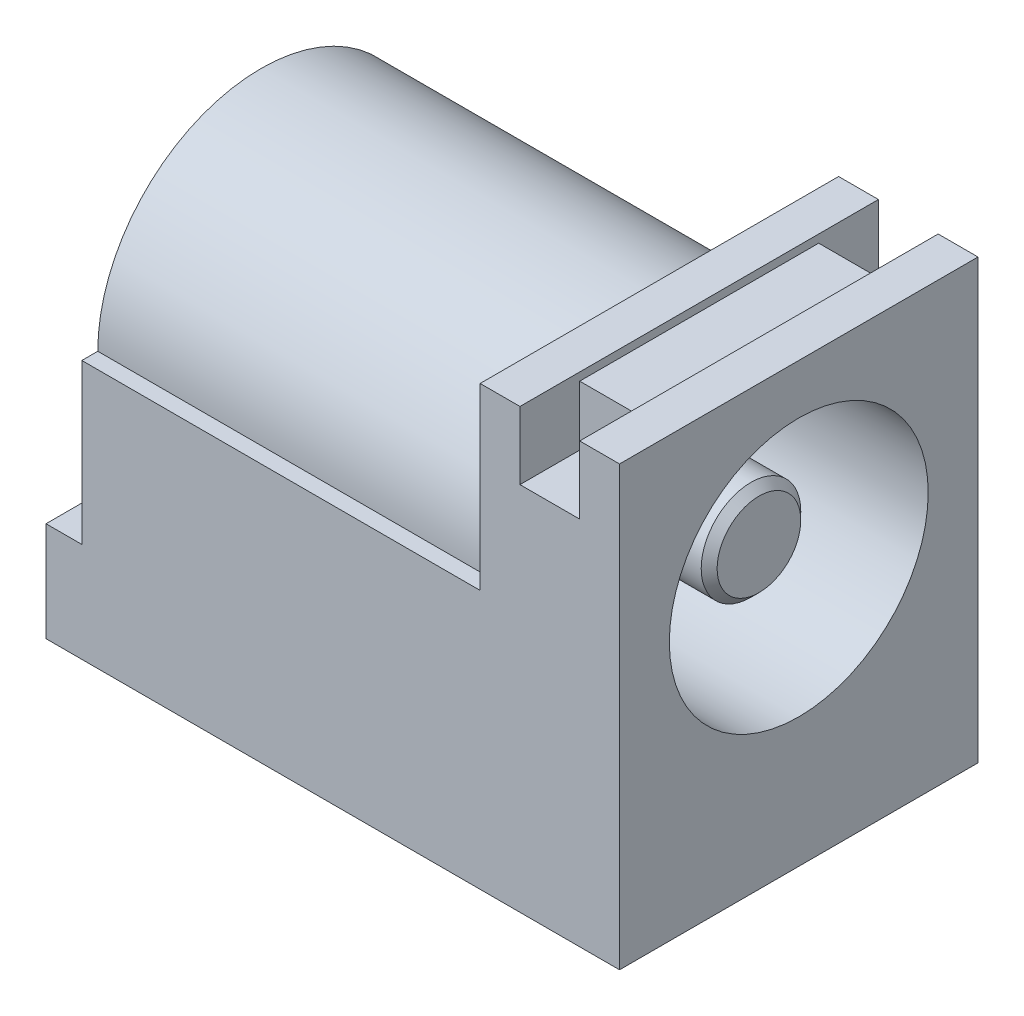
ISO-10303-21;
HEADER;
FILE_DESCRIPTION(('STEP AP214'),'2;1');
FILE_NAME('part.step','',(''),(''),'','','');
FILE_SCHEMA(('AUTOMOTIVE_DESIGN { 1 0 10303 214 1 1 1 1 }'));
ENDSEC;
DATA;
#1=APPLICATION_CONTEXT('core data for automotive mechanical design processes');
#2=APPLICATION_PROTOCOL_DEFINITION('international standard','automotive_design',2000,#1);
#3=PRODUCT_CONTEXT('',#1,'mechanical');
#4=PRODUCT('Part','Part','',(#3));
#5=PRODUCT_RELATED_PRODUCT_CATEGORY('part','',(#4));
#6=PRODUCT_DEFINITION_FORMATION('','',#4);
#7=PRODUCT_DEFINITION_CONTEXT('part definition',#1,'design');
#8=PRODUCT_DEFINITION('design','',#6,#7);
#9=PRODUCT_DEFINITION_SHAPE('','',#8);
#10=(LENGTH_UNIT() NAMED_UNIT(*) SI_UNIT(.MILLI.,.METRE.));
#11=(NAMED_UNIT(*) PLANE_ANGLE_UNIT() SI_UNIT($,.RADIAN.));
#12=(NAMED_UNIT(*) SI_UNIT($,.STERADIAN.) SOLID_ANGLE_UNIT());
#13=UNCERTAINTY_MEASURE_WITH_UNIT(LENGTH_MEASURE(1.E-05),#10,'distance_accuracy_value','');
#14=(GEOMETRIC_REPRESENTATION_CONTEXT(3) GLOBAL_UNCERTAINTY_ASSIGNED_CONTEXT((#13)) GLOBAL_UNIT_ASSIGNED_CONTEXT((#10,
#11,#12)) REPRESENTATION_CONTEXT('',''));
#15=CARTESIAN_POINT('',(0.,0.,0.));
#16=DIRECTION('',(0.,0.,1.));
#17=DIRECTION('',(1.,0.,0.));
#18=AXIS2_PLACEMENT_3D('',#15,#16,#17);
#19=CARTESIAN_POINT('',(-1.,0.,0.));
#20=DIRECTION('',(1.,0.,0.));
#21=DIRECTION('',(0.,0.,-1.));
#22=AXIS2_PLACEMENT_3D('',#19,#20,#21);
#23=PLANE('',#22);
#24=CARTESIAN_POINT('',(-1.0000000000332,0.,0.));
#25=DIRECTION('',(-1.,0.,0.));
#26=DIRECTION('',(0.,0.,1.));
#27=AXIS2_PLACEMENT_3D('',#24,#25,#26);
#28=CIRCLE('',#27,1.05000000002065);
#29=CARTESIAN_POINT('',(-1.0000000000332,0.,1.05000000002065));
#30=VERTEX_POINT('',#29);
#31=EDGE_CURVE('E19',#30,#30,#28,.T.);
#32=ORIENTED_EDGE('',*,*,#31,.F.);
#33=EDGE_LOOP('',(#32));
#34=FACE_BOUND('',#33,.T.);
#35=ADVANCED_FACE('F16',(#34),#23,.T.);
#36=CARTESIAN_POINT('',(-1.19999999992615,0.,0.));
#37=DIRECTION('',(-1.,0.,0.));
#38=DIRECTION('',(0.,0.,1.));
#39=AXIS2_PLACEMENT_3D('',#36,#37,#38);
#40=CONICAL_SURFACE('',#39,1.2499999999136,0.785398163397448);
#41=CARTESIAN_POINT('',(-1.2,0.,0.));
#42=DIRECTION('',(1.,0.,0.));
#43=DIRECTION('',(0.,0.,-1.));
#44=AXIS2_PLACEMENT_3D('',#41,#42,#43);
#45=CIRCLE('',#44,1.25);
#46=CARTESIAN_POINT('',(-1.2,0.,-1.25));
#47=VERTEX_POINT('',#46);
#48=EDGE_CURVE('E146',#47,#47,#45,.F.);
#49=ORIENTED_EDGE('',*,*,#48,.F.);
#50=EDGE_LOOP('',(#49));
#51=FACE_BOUND('',#50,.T.);
#52=ORIENTED_EDGE('',*,*,#31,.T.);
#53=EDGE_LOOP('',(#52));
#54=FACE_BOUND('',#53,.T.);
#55=ADVANCED_FACE('F1395',(#51,#54),#40,.T.);
#56=CARTESIAN_POINT('',(-13.52,-10.,1.5));
#57=DIRECTION('',(-1.,0.,0.));
#58=DIRECTION('',(0.,0.,1.));
#59=AXIS2_PLACEMENT_3D('',#56,#57,#58);
#60=PLANE('',#59);
#61=DIRECTION('',(0.,1.,0.));
#62=VECTOR('',#61,1.);
#63=CARTESIAN_POINT('',(-13.52,-10.,-0.5));
#64=LINE('',#63,#62);
#65=CARTESIAN_POINT('',(-13.52,-9.5,-0.5));
#66=VERTEX_POINT('',#65);
#67=CARTESIAN_POINT('',(-13.52,-6.5,-0.5));
#68=VERTEX_POINT('',#67);
#69=EDGE_CURVE('E165',#66,#68,#64,.T.);
#70=ORIENTED_EDGE('',*,*,#69,.T.);
#71=DIRECTION('',(0.,0.,1.));
#72=VECTOR('',#71,1.);
#73=CARTESIAN_POINT('',(-13.52,-6.5,1.5));
#74=LINE('',#73,#72);
#75=CARTESIAN_POINT('',(-13.52,-6.5,0.5));
#76=VERTEX_POINT('',#75);
#77=EDGE_CURVE('E154',#76,#68,#74,.F.);
#78=ORIENTED_EDGE('',*,*,#77,.F.);
#79=DIRECTION('',(0.,1.,0.));
#80=VECTOR('',#79,1.);
#81=CARTESIAN_POINT('',(-13.52,-10.,0.5));
#82=LINE('',#81,#80);
#83=CARTESIAN_POINT('',(-13.52,-9.5,0.5));
#84=VERTEX_POINT('',#83);
#85=EDGE_CURVE('E145',#76,#84,#82,.F.);
#86=ORIENTED_EDGE('',*,*,#85,.T.);
#87=CARTESIAN_POINT('',(-13.52,-9.5,0.));
#88=DIRECTION('',(1.,0.,0.));
#89=DIRECTION('',(0.,0.,-1.));
#90=AXIS2_PLACEMENT_3D('',#87,#88,#89);
#91=CIRCLE('',#90,0.5);
#92=EDGE_CURVE('E124',#66,#84,#91,.F.);
#93=ORIENTED_EDGE('',*,*,#92,.F.);
#94=EDGE_LOOP('',(#70,#78,#86,#93));
#95=FACE_BOUND('',#94,.T.);
#96=ADVANCED_FACE('F162',(#95),#60,.F.);
#97=CARTESIAN_POINT('',(-7.575,-10.,1.25));
#98=DIRECTION('',(-1.,0.,0.));
#99=DIRECTION('',(0.,0.,1.));
#100=AXIS2_PLACEMENT_3D('',#97,#98,#99);
#101=PLANE('',#100);
#102=CARTESIAN_POINT('',(-7.575,-9.5,0.));
#103=DIRECTION('',(1.,0.,0.));
#104=DIRECTION('',(0.,0.,-1.));
#105=AXIS2_PLACEMENT_3D('',#102,#103,#104);
#106=CIRCLE('',#105,0.5);
#107=CARTESIAN_POINT('',(-7.575,-9.5,-0.5));
#108=VERTEX_POINT('',#107);
#109=CARTESIAN_POINT('',(-7.575,-9.5,0.5));
#110=VERTEX_POINT('',#109);
#111=EDGE_CURVE('E241',#108,#110,#106,.F.);
#112=ORIENTED_EDGE('',*,*,#111,.F.);
#113=DIRECTION('',(0.,1.,0.));
#114=VECTOR('',#113,1.);
#115=CARTESIAN_POINT('',(-7.575,-10.,-0.5));
#116=LINE('',#115,#114);
#117=CARTESIAN_POINT('',(-7.575,-6.5,-0.5));
#118=VERTEX_POINT('',#117);
#119=EDGE_CURVE('E243',#108,#118,#116,.T.);
#120=ORIENTED_EDGE('',*,*,#119,.T.);
#121=DIRECTION('',(0.,0.,1.));
#122=VECTOR('',#121,1.);
#123=CARTESIAN_POINT('',(-7.575,-6.5,1.25));
#124=LINE('',#123,#122);
#125=CARTESIAN_POINT('',(-7.575,-6.5,0.5));
#126=VERTEX_POINT('',#125);
#127=EDGE_CURVE('E167',#126,#118,#124,.F.);
#128=ORIENTED_EDGE('',*,*,#127,.F.);
#129=DIRECTION('',(0.,1.,0.));
#130=VECTOR('',#129,1.);
#131=CARTESIAN_POINT('',(-7.575,-6.5,0.5));
#132=LINE('',#131,#130);
#133=EDGE_CURVE('E279',#126,#110,#132,.F.);
#134=ORIENTED_EDGE('',*,*,#133,.T.);
#135=EDGE_LOOP('',(#112,#120,#128,#134));
#136=FACE_BOUND('',#135,.T.);
#137=ADVANCED_FACE('F878',(#136),#101,.F.);
#138=CARTESIAN_POINT('',(-1.2,0.,0.));
#139=DIRECTION('',(1.,0.,0.));
#140=DIRECTION('',(0.,0.,-1.));
#141=AXIS2_PLACEMENT_3D('',#138,#139,#140);
#142=CYLINDRICAL_SURFACE('',#141,1.25);
#143=ORIENTED_EDGE('',*,*,#48,.T.);
#144=EDGE_LOOP('',(#143));
#145=FACE_BOUND('',#144,.T.);
#146=CARTESIAN_POINT('',(-7.,0.,0.));
#147=DIRECTION('',(1.,0.,0.));
#148=DIRECTION('',(0.,0.,-1.));
#149=AXIS2_PLACEMENT_3D('',#146,#147,#148);
#150=CIRCLE('',#149,1.25);
#151=CARTESIAN_POINT('',(-7.,0.,-1.25));
#152=VERTEX_POINT('',#151);
#153=EDGE_CURVE('E236',#152,#152,#150,.F.);
#154=ORIENTED_EDGE('',*,*,#153,.F.);
#155=EDGE_LOOP('',(#154));
#156=FACE_BOUND('',#155,.T.);
#157=ADVANCED_FACE('F1372',(#145,#156),#142,.T.);
#158=CARTESIAN_POINT('',(-8.741817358,-10.,0.5));
#159=DIRECTION('',(0.,0.,-1.));
#160=DIRECTION('',(-1.,0.,0.));
#161=AXIS2_PLACEMENT_3D('',#158,#159,#160);
#162=PLANE('',#161);
#163=ORIENTED_EDGE('',*,*,#85,.F.);
#164=DIRECTION('',(0.,1.,0.));
#165=VECTOR('',#164,1.);
#166=CARTESIAN_POINT('',(-13.52,-10.,0.5));
#167=LINE('',#166,#165);
#168=CARTESIAN_POINT('',(-13.52,-6.4,0.5));
#169=VERTEX_POINT('',#168);
#170=EDGE_CURVE('E131',#169,#76,#167,.F.);
#171=ORIENTED_EDGE('',*,*,#170,.F.);
#172=DIRECTION('',(1.,0.,0.));
#173=VECTOR('',#172,1.);
#174=CARTESIAN_POINT('',(-8.741817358,-6.4,0.5));
#175=LINE('',#174,#173);
#176=CARTESIAN_POINT('',(-13.88,-6.4,0.5));
#177=VERTEX_POINT('',#176);
#178=EDGE_CURVE('E290',#169,#177,#175,.F.);
#179=ORIENTED_EDGE('',*,*,#178,.T.);
#180=DIRECTION('',(0.,1.,0.));
#181=VECTOR('',#180,1.);
#182=CARTESIAN_POINT('',(-13.88,-10.,0.5));
#183=LINE('',#182,#181);
#184=CARTESIAN_POINT('',(-13.88,-9.5,0.5));
#185=VERTEX_POINT('',#184);
#186=EDGE_CURVE('E235',#177,#185,#183,.F.);
#187=ORIENTED_EDGE('',*,*,#186,.T.);
#188=DIRECTION('',(1.,0.,0.));
#189=VECTOR('',#188,1.);
#190=CARTESIAN_POINT('',(-13.52,-9.5,0.5));
#191=LINE('',#190,#189);
#192=EDGE_CURVE('E171',#84,#185,#191,.F.);
#193=ORIENTED_EDGE('',*,*,#192,.F.);
#194=EDGE_LOOP('',(#163,#171,#179,#187,#193));
#195=FACE_BOUND('',#194,.T.);
#196=ADVANCED_FACE('F169',(#195),#162,.F.);
#197=CARTESIAN_POINT('',(-13.52,-9.5,0.));
#198=DIRECTION('',(1.,0.,0.));
#199=DIRECTION('',(0.,0.,-1.));
#200=AXIS2_PLACEMENT_3D('',#197,#198,#199);
#201=CYLINDRICAL_SURFACE('',#200,0.5);
#202=DIRECTION('',(1.,0.,0.));
#203=VECTOR('',#202,1.);
#204=CARTESIAN_POINT('',(-8.741817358,-9.5,-0.5));
#205=LINE('',#204,#203);
#206=CARTESIAN_POINT('',(-13.88,-9.5,-0.5));
#207=VERTEX_POINT('',#206);
#208=EDGE_CURVE('E248',#207,#66,#205,.T.);
#209=ORIENTED_EDGE('',*,*,#208,.T.);
#210=ORIENTED_EDGE('',*,*,#92,.T.);
#211=ORIENTED_EDGE('',*,*,#192,.T.);
#212=CARTESIAN_POINT('',(-13.88,-9.5,0.));
#213=DIRECTION('',(1.,0.,0.));
#214=DIRECTION('',(0.,0.,-1.));
#215=AXIS2_PLACEMENT_3D('',#212,#213,#214);
#216=CIRCLE('',#215,0.5);
#217=EDGE_CURVE('E232',#185,#207,#216,.T.);
#218=ORIENTED_EDGE('',*,*,#217,.T.);
#219=EDGE_LOOP('',(#209,#210,#211,#218));
#220=FACE_BOUND('',#219,.T.);
#221=ADVANCED_FACE('F1356',(#220),#201,.T.);
#222=CARTESIAN_POINT('',(-8.741817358,-10.,-0.5));
#223=DIRECTION('',(0.,0.,1.));
#224=DIRECTION('',(1.,0.,0.));
#225=AXIS2_PLACEMENT_3D('',#222,#223,#224);
#226=PLANE('',#225);
#227=DIRECTION('',(0.,1.,0.));
#228=VECTOR('',#227,1.);
#229=CARTESIAN_POINT('',(-13.88,-10.,-0.5));
#230=LINE('',#229,#228);
#231=CARTESIAN_POINT('',(-13.88,-6.4,-0.5));
#232=VERTEX_POINT('',#231);
#233=EDGE_CURVE('E234',#207,#232,#230,.T.);
#234=ORIENTED_EDGE('',*,*,#233,.T.);
#235=DIRECTION('',(1.,0.,0.));
#236=VECTOR('',#235,1.);
#237=CARTESIAN_POINT('',(-8.741817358,-6.4,-0.5));
#238=LINE('',#237,#236);
#239=CARTESIAN_POINT('',(-13.52,-6.4,-0.5));
#240=VERTEX_POINT('',#239);
#241=EDGE_CURVE('E308',#232,#240,#238,.T.);
#242=ORIENTED_EDGE('',*,*,#241,.T.);
#243=DIRECTION('',(0.,1.,0.));
#244=VECTOR('',#243,1.);
#245=CARTESIAN_POINT('',(-13.52,-10.,-0.5));
#246=LINE('',#245,#244);
#247=EDGE_CURVE('E245',#68,#240,#246,.T.);
#248=ORIENTED_EDGE('',*,*,#247,.F.);
#249=ORIENTED_EDGE('',*,*,#69,.F.);
#250=ORIENTED_EDGE('',*,*,#208,.F.);
#251=EDGE_LOOP('',(#234,#242,#248,#249,#250));
#252=FACE_BOUND('',#251,.T.);
#253=ADVANCED_FACE('F1347',(#252),#226,.F.);
#254=CARTESIAN_POINT('',(-8.741817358,-6.4,0.5));
#255=DIRECTION('',(0.,0.681998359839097,-0.731353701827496));
#256=DIRECTION('',(0.,0.731353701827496,0.681998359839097));
#257=AXIS2_PLACEMENT_3D('',#254,#255,#256);
#258=PLANE('',#257);
#259=DIRECTION('',(0.,-0.731353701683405,-0.681998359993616));
#260=VECTOR('',#259,1.);
#261=CARTESIAN_POINT('',(-13.88,-5.327631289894,1.499999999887));
#262=LINE('',#261,#260);
#263=CARTESIAN_POINT('',(-13.88,-5.32763128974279,1.49999999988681));
#264=VERTEX_POINT('',#263);
#265=EDGE_CURVE('E296',#264,#177,#262,.T.);
#266=ORIENTED_EDGE('',*,*,#265,.T.);
#267=ORIENTED_EDGE('',*,*,#178,.F.);
#268=DIRECTION('',(0.,-0.731353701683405,-0.681998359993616));
#269=VECTOR('',#268,1.);
#270=CARTESIAN_POINT('',(-13.52,-5.327631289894,1.499999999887));
#271=LINE('',#270,#269);
#272=CARTESIAN_POINT('',(-13.52,-5.32763128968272,1.49999999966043));
#273=VERTEX_POINT('',#272);
#274=EDGE_CURVE('E140',#273,#169,#271,.T.);
#275=ORIENTED_EDGE('',*,*,#274,.F.);
#276=DIRECTION('',(1.,0.,0.));
#277=VECTOR('',#276,1.);
#278=CARTESIAN_POINT('',(-8.741817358,-5.32763128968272,1.49999999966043));
#279=LINE('',#278,#277);
#280=EDGE_CURVE('E286',#264,#273,#279,.T.);
#281=ORIENTED_EDGE('',*,*,#280,.F.);
#282=EDGE_LOOP('',(#266,#267,#275,#281));
#283=FACE_BOUND('',#282,.T.);
#284=ADVANCED_FACE('F1338',(#283),#258,.F.);
#285=CARTESIAN_POINT('',(-8.741817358,-6.4,-0.5));
#286=DIRECTION('',(0.,0.681998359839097,0.731353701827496));
#287=DIRECTION('',(0.,-0.731353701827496,0.681998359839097));
#288=AXIS2_PLACEMENT_3D('',#285,#286,#287);
#289=PLANE('',#288);
#290=DIRECTION('',(0.,0.731353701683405,-0.681998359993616));
#291=VECTOR('',#290,1.);
#292=CARTESIAN_POINT('',(-13.88,-6.4,-0.5));
#293=LINE('',#292,#291);
#294=CARTESIAN_POINT('',(-13.88,-5.32763128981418,-1.49999999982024));
#295=VERTEX_POINT('',#294);
#296=EDGE_CURVE('E302',#232,#295,#293,.T.);
#297=ORIENTED_EDGE('',*,*,#296,.T.);
#298=DIRECTION('',(1.,0.,0.));
#299=VECTOR('',#298,1.);
#300=CARTESIAN_POINT('',(-8.741817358,-5.32763128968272,-1.49999999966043));
#301=LINE('',#300,#299);
#302=CARTESIAN_POINT('',(-13.52,-5.32763128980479,-1.49999999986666));
#303=VERTEX_POINT('',#302);
#304=EDGE_CURVE('E289',#303,#295,#301,.F.);
#305=ORIENTED_EDGE('',*,*,#304,.F.);
#306=DIRECTION('',(0.,0.731353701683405,-0.681998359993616));
#307=VECTOR('',#306,1.);
#308=CARTESIAN_POINT('',(-13.52,-6.4,-0.5));
#309=LINE('',#308,#307);
#310=EDGE_CURVE('E264',#240,#303,#309,.T.);
#311=ORIENTED_EDGE('',*,*,#310,.F.);
#312=ORIENTED_EDGE('',*,*,#241,.F.);
#313=EDGE_LOOP('',(#297,#305,#311,#312));
#314=FACE_BOUND('',#313,.T.);
#315=ADVANCED_FACE('F1329',(#314),#289,.F.);
#316=CARTESIAN_POINT('',(-11.2,-7.004276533,-0.626693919));
#317=DIRECTION('',(1.,0.,0.));
#318=DIRECTION('',(0.,0.,-1.));
#319=AXIS2_PLACEMENT_3D('',#316,#317,#318);
#320=PLANE('',#319);
#321=DIRECTION('',(0.,1.,0.));
#322=VECTOR('',#321,1.);
#323=CARTESIAN_POINT('',(-11.2,-10.,-4.5));
#324=LINE('',#323,#322);
#325=CARTESIAN_POINT('',(-11.2,-9.5,-4.5));
#326=VERTEX_POINT('',#325);
#327=CARTESIAN_POINT('',(-11.2,-7.004276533,-4.5));
#328=VERTEX_POINT('',#327);
#329=EDGE_CURVE('E392',#326,#328,#324,.T.);
#330=ORIENTED_EDGE('',*,*,#329,.T.);
#331=DIRECTION('',(0.,0.,-1.));
#332=VECTOR('',#331,1.);
#333=CARTESIAN_POINT('',(-11.2,-7.004276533,-0.626693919));
#334=LINE('',#333,#332);
#335=CARTESIAN_POINT('',(-11.2,-7.004276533,-4.9));
#336=VERTEX_POINT('',#335);
#337=EDGE_CURVE('E311',#336,#328,#334,.F.);
#338=ORIENTED_EDGE('',*,*,#337,.F.);
#339=DIRECTION('',(0.,1.,0.));
#340=VECTOR('',#339,1.);
#341=CARTESIAN_POINT('',(-11.2,-10.,-4.9));
#342=LINE('',#341,#340);
#343=CARTESIAN_POINT('',(-11.2,-9.5,-4.9));
#344=VERTEX_POINT('',#343);
#345=EDGE_CURVE('E231',#336,#344,#342,.F.);
#346=ORIENTED_EDGE('',*,*,#345,.T.);
#347=DIRECTION('',(0.,0.,-1.));
#348=VECTOR('',#347,1.);
#349=CARTESIAN_POINT('',(-11.2,-9.5,-4.9));
#350=LINE('',#349,#348);
#351=EDGE_CURVE('E325',#326,#344,#350,.T.);
#352=ORIENTED_EDGE('',*,*,#351,.F.);
#353=EDGE_LOOP('',(#330,#338,#346,#352));
#354=FACE_BOUND('',#353,.T.);
#355=ADVANCED_FACE('F1320',(#354),#320,.F.);
#356=CARTESIAN_POINT('',(-10.2,-7.004276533,-0.626693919));
#357=DIRECTION('',(-1.,0.,0.));
#358=DIRECTION('',(0.,0.,1.));
#359=AXIS2_PLACEMENT_3D('',#356,#357,#358);
#360=PLANE('',#359);
#361=DIRECTION('',(0.,1.,0.));
#362=VECTOR('',#361,1.);
#363=CARTESIAN_POINT('',(-10.2,-10.,-4.9));
#364=LINE('',#363,#362);
#365=CARTESIAN_POINT('',(-10.2,-9.5,-4.9));
#366=VERTEX_POINT('',#365);
#367=CARTESIAN_POINT('',(-10.2,-7.004276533,-4.9));
#368=VERTEX_POINT('',#367);
#369=EDGE_CURVE('E408',#366,#368,#364,.T.);
#370=ORIENTED_EDGE('',*,*,#369,.T.);
#371=DIRECTION('',(0.,0.,1.));
#372=VECTOR('',#371,1.);
#373=CARTESIAN_POINT('',(-10.2,-7.004276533,-0.626693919));
#374=LINE('',#373,#372);
#375=CARTESIAN_POINT('',(-10.2,-7.004276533,-4.5));
#376=VERTEX_POINT('',#375);
#377=EDGE_CURVE('E320',#376,#368,#374,.F.);
#378=ORIENTED_EDGE('',*,*,#377,.F.);
#379=DIRECTION('',(0.,1.,0.));
#380=VECTOR('',#379,1.);
#381=CARTESIAN_POINT('',(-10.2,-10.,-4.5));
#382=LINE('',#381,#380);
#383=CARTESIAN_POINT('',(-10.2,-9.5,-4.5));
#384=VERTEX_POINT('',#383);
#385=EDGE_CURVE('E226',#376,#384,#382,.F.);
#386=ORIENTED_EDGE('',*,*,#385,.T.);
#387=DIRECTION('',(0.,0.,-1.));
#388=VECTOR('',#387,1.);
#389=CARTESIAN_POINT('',(-10.2,-9.5,-4.9));
#390=LINE('',#389,#388);
#391=EDGE_CURVE('E244',#366,#384,#390,.F.);
#392=ORIENTED_EDGE('',*,*,#391,.F.);
#393=EDGE_LOOP('',(#370,#378,#386,#392));
#394=FACE_BOUND('',#393,.T.);
#395=ADVANCED_FACE('F898',(#394),#360,.F.);
#396=CARTESIAN_POINT('',(-10.7,-9.5,-4.9));
#397=DIRECTION('',(0.,0.,-1.));
#398=DIRECTION('',(-1.,0.,0.));
#399=AXIS2_PLACEMENT_3D('',#396,#397,#398);
#400=CYLINDRICAL_SURFACE('',#399,0.5);
#401=CARTESIAN_POINT('',(-10.7,-9.5,-4.9));
#402=DIRECTION('',(0.,0.,-1.));
#403=DIRECTION('',(-1.,0.,0.));
#404=AXIS2_PLACEMENT_3D('',#401,#402,#403);
#405=CIRCLE('',#404,0.5);
#406=EDGE_CURVE('E227',#344,#366,#405,.F.);
#407=ORIENTED_EDGE('',*,*,#406,.T.);
#408=ORIENTED_EDGE('',*,*,#391,.T.);
#409=CARTESIAN_POINT('',(-10.7,-9.5,-4.5));
#410=DIRECTION('',(0.,0.,-1.));
#411=DIRECTION('',(-1.,0.,0.));
#412=AXIS2_PLACEMENT_3D('',#409,#410,#411);
#413=CIRCLE('',#412,0.5);
#414=EDGE_CURVE('E222',#384,#326,#413,.T.);
#415=ORIENTED_EDGE('',*,*,#414,.T.);
#416=ORIENTED_EDGE('',*,*,#351,.T.);
#417=EDGE_LOOP('',(#407,#408,#415,#416));
#418=FACE_BOUND('',#417,.T.);
#419=ADVANCED_FACE('F890',(#418),#400,.T.);
#420=CARTESIAN_POINT('',(0.,-10.,-0.5));
#421=DIRECTION('',(0.,0.,1.));
#422=DIRECTION('',(1.,0.,0.));
#423=AXIS2_PLACEMENT_3D('',#420,#421,#422);
#424=PLANE('',#423);
#425=DIRECTION('',(0.,1.,0.));
#426=VECTOR('',#425,1.);
#427=CARTESIAN_POINT('',(-7.825,-10.,-0.5));
#428=LINE('',#427,#426);
#429=CARTESIAN_POINT('',(-7.825,-9.5,-0.5));
#430=VERTEX_POINT('',#429);
#431=CARTESIAN_POINT('',(-7.825,-6.5,-0.5));
#432=VERTEX_POINT('',#431);
#433=EDGE_CURVE('E225',#430,#432,#428,.T.);
#434=ORIENTED_EDGE('',*,*,#433,.T.);
#435=DIRECTION('',(1.,0.,0.));
#436=VECTOR('',#435,1.);
#437=CARTESIAN_POINT('',(0.,-6.5,-0.5));
#438=LINE('',#437,#436);
#439=EDGE_CURVE('E272',#118,#432,#438,.F.);
#440=ORIENTED_EDGE('',*,*,#439,.F.);
#441=ORIENTED_EDGE('',*,*,#119,.F.);
#442=DIRECTION('',(1.,0.,0.));
#443=VECTOR('',#442,1.);
#444=CARTESIAN_POINT('',(0.,-9.5,-0.5));
#445=LINE('',#444,#443);
#446=EDGE_CURVE('E334',#430,#108,#445,.T.);
#447=ORIENTED_EDGE('',*,*,#446,.F.);
#448=EDGE_LOOP('',(#434,#440,#441,#447));
#449=FACE_BOUND('',#448,.T.);
#450=ADVANCED_FACE('F888',(#449),#424,.F.);
#451=CARTESIAN_POINT('',(0.,-6.5,0.5));
#452=DIRECTION('',(0.,0.,-1.));
#453=DIRECTION('',(-1.,0.,0.));
#454=AXIS2_PLACEMENT_3D('',#451,#452,#453);
#455=PLANE('',#454);
#456=ORIENTED_EDGE('',*,*,#133,.F.);
#457=DIRECTION('',(-1.,0.,0.));
#458=VECTOR('',#457,1.);
#459=CARTESIAN_POINT('',(0.,-6.5,0.5));
#460=LINE('',#459,#458);
#461=CARTESIAN_POINT('',(-7.825,-6.5,0.5));
#462=VERTEX_POINT('',#461);
#463=EDGE_CURVE('E283',#462,#126,#460,.F.);
#464=ORIENTED_EDGE('',*,*,#463,.F.);
#465=DIRECTION('',(0.,1.,0.));
#466=VECTOR('',#465,1.);
#467=CARTESIAN_POINT('',(-7.825,-10.,0.5));
#468=LINE('',#467,#466);
#469=CARTESIAN_POINT('',(-7.825,-9.5,0.5));
#470=VERTEX_POINT('',#469);
#471=EDGE_CURVE('E221',#462,#470,#468,.F.);
#472=ORIENTED_EDGE('',*,*,#471,.T.);
#473=DIRECTION('',(-1.,0.,0.));
#474=VECTOR('',#473,1.);
#475=CARTESIAN_POINT('',(-7.825,-9.5,0.5));
#476=LINE('',#475,#474);
#477=EDGE_CURVE('E282',#110,#470,#476,.T.);
#478=ORIENTED_EDGE('',*,*,#477,.F.);
#479=EDGE_LOOP('',(#456,#464,#472,#478));
#480=FACE_BOUND('',#479,.T.);
#481=ADVANCED_FACE('F880',(#480),#455,.F.);
#482=CARTESIAN_POINT('',(-7.825,-9.5,0.));
#483=DIRECTION('',(-1.,0.,0.));
#484=DIRECTION('',(0.,0.,1.));
#485=AXIS2_PLACEMENT_3D('',#482,#483,#484);
#486=CYLINDRICAL_SURFACE('',#485,0.5);
#487=ORIENTED_EDGE('',*,*,#477,.T.);
#488=CARTESIAN_POINT('',(-7.825,-9.5,0.));
#489=DIRECTION('',(-1.,0.,0.));
#490=DIRECTION('',(0.,0.,1.));
#491=AXIS2_PLACEMENT_3D('',#488,#489,#490);
#492=CIRCLE('',#491,0.5);
#493=EDGE_CURVE('E218',#470,#430,#492,.F.);
#494=ORIENTED_EDGE('',*,*,#493,.T.);
#495=ORIENTED_EDGE('',*,*,#446,.T.);
#496=ORIENTED_EDGE('',*,*,#111,.T.);
#497=EDGE_LOOP('',(#487,#494,#495,#496));
#498=FACE_BOUND('',#497,.T.);
#499=ADVANCED_FACE('F871',(#498),#486,.T.);
#500=CARTESIAN_POINT('',(-1.,2.8,-4.5));
#501=DIRECTION('',(1.,0.,0.));
#502=DIRECTION('',(0.,0.,-1.));
#503=AXIS2_PLACEMENT_3D('',#500,#501,#502);
#504=PLANE('',#503);
#505=DIRECTION('',(0.,0.,-1.));
#506=VECTOR('',#505,1.);
#507=CARTESIAN_POINT('',(-1.,2.8,-4.5));
#508=LINE('',#507,#506);
#509=CARTESIAN_POINT('',(-1.,2.8,-3.));
#510=VERTEX_POINT('',#509);
#511=CARTESIAN_POINT('',(-1.,2.8,-4.5));
#512=VERTEX_POINT('',#511);
#513=EDGE_CURVE('E359',#510,#512,#508,.T.);
#514=ORIENTED_EDGE('',*,*,#513,.F.);
#515=DIRECTION('',(0.,1.,0.));
#516=VECTOR('',#515,1.);
#517=CARTESIAN_POINT('',(-1.,2.8,-3.));
#518=LINE('',#517,#516);
#519=CARTESIAN_POINT('',(-1.,4.3,-3.));
#520=VERTEX_POINT('',#519);
#521=EDGE_CURVE('E230',#510,#520,#518,.T.);
#522=ORIENTED_EDGE('',*,*,#521,.T.);
#523=DIRECTION('',(0.,0.,-1.));
#524=VECTOR('',#523,1.);
#525=CARTESIAN_POINT('',(-1.,4.3,3.));
#526=LINE('',#525,#524);
#527=CARTESIAN_POINT('',(-1.,4.3,3.));
#528=VERTEX_POINT('',#527);
#529=EDGE_CURVE('E377',#520,#528,#526,.F.);
#530=ORIENTED_EDGE('',*,*,#529,.T.);
#531=DIRECTION('',(0.,1.,0.));
#532=VECTOR('',#531,1.);
#533=CARTESIAN_POINT('',(-1.,2.8,3.));
#534=LINE('',#533,#532);
#535=CARTESIAN_POINT('',(-1.,2.8,3.));
#536=VERTEX_POINT('',#535);
#537=EDGE_CURVE('E356',#536,#528,#534,.T.);
#538=ORIENTED_EDGE('',*,*,#537,.F.);
#539=DIRECTION('',(0.,0.,-1.));
#540=VECTOR('',#539,1.);
#541=CARTESIAN_POINT('',(-1.,2.8,-4.5));
#542=LINE('',#541,#540);
#543=CARTESIAN_POINT('',(-1.,2.8,4.5));
#544=VERTEX_POINT('',#543);
#545=EDGE_CURVE('E353',#544,#536,#542,.T.);
#546=ORIENTED_EDGE('',*,*,#545,.F.);
#547=DIRECTION('',(0.,1.,0.));
#548=VECTOR('',#547,1.);
#549=CARTESIAN_POINT('',(-1.,2.8,4.5));
#550=LINE('',#549,#548);
#551=CARTESIAN_POINT('',(-0.999999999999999,4.5,4.5));
#552=VERTEX_POINT('',#551);
#553=EDGE_CURVE('E350',#552,#544,#550,.F.);
#554=ORIENTED_EDGE('',*,*,#553,.F.);
#555=DIRECTION('',(0.,0.,1.));
#556=VECTOR('',#555,1.);
#557=CARTESIAN_POINT('',(-0.999999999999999,4.5,4.5));
#558=LINE('',#557,#556);
#559=CARTESIAN_POINT('',(-0.999999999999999,4.5,-4.5));
#560=VERTEX_POINT('',#559);
#561=EDGE_CURVE('E217',#560,#552,#558,.T.);
#562=ORIENTED_EDGE('',*,*,#561,.F.);
#563=DIRECTION('',(0.,1.,0.));
#564=VECTOR('',#563,1.);
#565=CARTESIAN_POINT('',(-1.,2.8,-4.5));
#566=LINE('',#565,#564);
#567=EDGE_CURVE('E240',#512,#560,#566,.T.);
#568=ORIENTED_EDGE('',*,*,#567,.F.);
#569=EDGE_LOOP('',(#514,#522,#530,#538,#546,#554,#562,#568));
#570=FACE_BOUND('',#569,.T.);
#571=ADVANCED_FACE('F1042',(#570),#504,.F.);
#572=CARTESIAN_POINT('',(-7.,0.,0.));
#573=DIRECTION('',(1.,0.,0.));
#574=DIRECTION('',(0.,0.,-1.));
#575=AXIS2_PLACEMENT_3D('',#572,#573,#574);
#576=PLANE('',#575);
#577=ORIENTED_EDGE('',*,*,#153,.T.);
#578=EDGE_LOOP('',(#577));
#579=FACE_BOUND('',#578,.T.);
#580=CARTESIAN_POINT('',(-7.,0.,0.));
#581=DIRECTION('',(1.,0.,0.));
#582=DIRECTION('',(0.,0.,-1.));
#583=AXIS2_PLACEMENT_3D('',#580,#581,#582);
#584=CIRCLE('',#583,3.25);
#585=CARTESIAN_POINT('',(-7.,0.,-3.25));
#586=VERTEX_POINT('',#585);
#587=EDGE_CURVE('E213',#586,#586,#584,.T.);
#588=ORIENTED_EDGE('',*,*,#587,.T.);
#589=EDGE_LOOP('',(#588));
#590=FACE_BOUND('',#589,.T.);
#591=ADVANCED_FACE('F1038',(#579,#590),#576,.T.);
#592=CARTESIAN_POINT('',(-13.88,-10.,1.5));
#593=DIRECTION('',(1.,0.,0.));
#594=DIRECTION('',(0.,0.,-1.));
#595=AXIS2_PLACEMENT_3D('',#592,#593,#594);
#596=PLANE('',#595);
#597=DIRECTION('',(0.,1.,0.));
#598=VECTOR('',#597,1.);
#599=CARTESIAN_POINT('',(-13.88,-10.,-1.5));
#600=LINE('',#599,#598);
#601=CARTESIAN_POINT('',(-13.88,1.62,-1.5));
#602=VERTEX_POINT('',#601);
#603=CARTESIAN_POINT('',(-13.88,-4.,-1.49999999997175));
#604=VERTEX_POINT('',#603);
#605=EDGE_CURVE('E211',#602,#604,#600,.F.);
#606=ORIENTED_EDGE('',*,*,#605,.T.);
#607=DIRECTION('',(0.,1.,0.));
#608=VECTOR('',#607,1.);
#609=CARTESIAN_POINT('',(-13.88,-10.,-1.499999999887));
#610=LINE('',#609,#608);
#611=EDGE_CURVE('E305',#295,#604,#610,.T.);
#612=ORIENTED_EDGE('',*,*,#611,.F.);
#613=ORIENTED_EDGE('',*,*,#296,.F.);
#614=ORIENTED_EDGE('',*,*,#233,.F.);
#615=ORIENTED_EDGE('',*,*,#217,.F.);
#616=ORIENTED_EDGE('',*,*,#186,.F.);
#617=ORIENTED_EDGE('',*,*,#265,.F.);
#618=DIRECTION('',(0.,1.,0.));
#619=VECTOR('',#618,1.);
#620=CARTESIAN_POINT('',(-13.88,-10.,1.5));
#621=LINE('',#620,#619);
#622=CARTESIAN_POINT('',(-13.88,-4.,1.5));
#623=VERTEX_POINT('',#622);
#624=EDGE_CURVE('E239',#623,#264,#621,.F.);
#625=ORIENTED_EDGE('',*,*,#624,.F.);
#626=DIRECTION('',(0.,1.,0.));
#627=VECTOR('',#626,1.);
#628=CARTESIAN_POINT('',(-13.88,-10.,1.5));
#629=LINE('',#628,#627);
#630=CARTESIAN_POINT('',(-13.88,1.62,1.5));
#631=VERTEX_POINT('',#630);
#632=EDGE_CURVE('E387',#623,#631,#629,.T.);
#633=ORIENTED_EDGE('',*,*,#632,.T.);
#634=DIRECTION('',(0.,0.,1.));
#635=VECTOR('',#634,1.);
#636=CARTESIAN_POINT('',(-13.88,1.62,1.5));
#637=LINE('',#636,#635);
#638=EDGE_CURVE('E212',#602,#631,#637,.T.);
#639=ORIENTED_EDGE('',*,*,#638,.F.);
#640=EDGE_LOOP('',(#606,#612,#613,#614,#615,#616,#617,#625,#633,#639));
#641=FACE_BOUND('',#640,.T.);
#642=ADVANCED_FACE('F1034',(#641),#596,.F.);
#643=CARTESIAN_POINT('',(-1.,4.3,3.));
#644=DIRECTION('',(0.,-1.,0.));
#645=DIRECTION('',(0.,0.,-1.));
#646=AXIS2_PLACEMENT_3D('',#643,#644,#645);
#647=PLANE('',#646);
#648=DIRECTION('',(0.,0.,1.));
#649=VECTOR('',#648,1.);
#650=CARTESIAN_POINT('',(-2.5,4.3,-4.5));
#651=LINE('',#650,#649);
#652=CARTESIAN_POINT('',(-2.5,4.3,-3.));
#653=VERTEX_POINT('',#652);
#654=CARTESIAN_POINT('',(-2.5,4.3,3.));
#655=VERTEX_POINT('',#654);
#656=EDGE_CURVE('E529',#653,#655,#651,.T.);
#657=ORIENTED_EDGE('',*,*,#656,.T.);
#658=DIRECTION('',(-1.,0.,0.));
#659=VECTOR('',#658,1.);
#660=CARTESIAN_POINT('',(-1.,4.3,3.));
#661=LINE('',#660,#659);
#662=EDGE_CURVE('E216',#655,#528,#661,.F.);
#663=ORIENTED_EDGE('',*,*,#662,.T.);
#664=ORIENTED_EDGE('',*,*,#529,.F.);
#665=DIRECTION('',(1.,0.,0.));
#666=VECTOR('',#665,1.);
#667=CARTESIAN_POINT('',(-1.,4.3,-3.));
#668=LINE('',#667,#666);
#669=EDGE_CURVE('E265',#520,#653,#668,.F.);
#670=ORIENTED_EDGE('',*,*,#669,.T.);
#671=EDGE_LOOP('',(#657,#663,#664,#670));
#672=FACE_BOUND('',#671,.T.);
#673=ADVANCED_FACE('F1030',(#672),#647,.F.);
#674=CARTESIAN_POINT('',(-11.95,-10.,-4.9));
#675=DIRECTION('',(0.,0.,1.));
#676=DIRECTION('',(1.,0.,0.));
#677=AXIS2_PLACEMENT_3D('',#674,#675,#676);
#678=PLANE('',#677);
#679=ORIENTED_EDGE('',*,*,#345,.F.);
#680=DIRECTION('',(0.681998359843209,-0.731353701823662,0.));
#681=VECTOR('',#680,1.);
#682=CARTESIAN_POINT('',(-11.95,-6.199999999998,-4.9));
#683=LINE('',#682,#681);
#684=CARTESIAN_POINT('',(-11.9499999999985,-6.19999999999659,-4.9));
#685=VERTEX_POINT('',#684);
#686=EDGE_CURVE('E431',#685,#336,#683,.T.);
#687=ORIENTED_EDGE('',*,*,#686,.F.);
#688=DIRECTION('',(0.,1.,0.));
#689=VECTOR('',#688,1.);
#690=CARTESIAN_POINT('',(-11.95,-10.,-4.9));
#691=LINE('',#690,#689);
#692=CARTESIAN_POINT('',(-11.95,-3.989897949,-4.9));
#693=VERTEX_POINT('',#692);
#694=EDGE_CURVE('E195',#685,#693,#691,.T.);
#695=ORIENTED_EDGE('',*,*,#694,.T.);
#696=DIRECTION('',(1.,0.,0.));
#697=VECTOR('',#696,1.);
#698=CARTESIAN_POINT('',(-11.95,-3.989897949,-4.9));
#699=LINE('',#698,#697);
#700=CARTESIAN_POINT('',(-9.45,-3.989897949,-4.9));
#701=VERTEX_POINT('',#700);
#702=EDGE_CURVE('E196',#701,#693,#699,.F.);
#703=ORIENTED_EDGE('',*,*,#702,.F.);
#704=DIRECTION('',(0.,1.,0.));
#705=VECTOR('',#704,1.);
#706=CARTESIAN_POINT('',(-9.45,-10.,-4.9));
#707=LINE('',#706,#705);
#708=CARTESIAN_POINT('',(-9.45000000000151,-6.19999999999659,-4.9));
#709=VERTEX_POINT('',#708);
#710=EDGE_CURVE('E544',#701,#709,#707,.F.);
#711=ORIENTED_EDGE('',*,*,#710,.T.);
#712=DIRECTION('',(-0.681998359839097,-0.731353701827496,0.));
#713=VECTOR('',#712,1.);
#714=CARTESIAN_POINT('',(-10.2,-7.004276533,-4.9));
#715=LINE('',#714,#713);
#716=EDGE_CURVE('E424',#709,#368,#715,.T.);
#717=ORIENTED_EDGE('',*,*,#716,.T.);
#718=ORIENTED_EDGE('',*,*,#369,.F.);
#719=ORIENTED_EDGE('',*,*,#406,.F.);
#720=EDGE_LOOP('',(#679,#687,#695,#703,#711,#717,#718,#719));
#721=FACE_BOUND('',#720,.T.);
#722=ADVANCED_FACE('F1026',(#721),#678,.F.);
#723=CARTESIAN_POINT('',(-1.,2.8,-3.));
#724=DIRECTION('',(0.,0.,1.));
#725=DIRECTION('',(1.,0.,0.));
#726=AXIS2_PLACEMENT_3D('',#723,#724,#725);
#727=PLANE('',#726);
#728=ORIENTED_EDGE('',*,*,#521,.F.);
#729=DIRECTION('',(1.,0.,0.));
#730=VECTOR('',#729,1.);
#731=CARTESIAN_POINT('',(-1.,2.8,-3.));
#732=LINE('',#731,#730);
#733=CARTESIAN_POINT('',(-2.5,2.8,-3.));
#734=VERTEX_POINT('',#733);
#735=EDGE_CURVE('E405',#510,#734,#732,.F.);
#736=ORIENTED_EDGE('',*,*,#735,.T.);
#737=DIRECTION('',(0.,1.,0.));
#738=VECTOR('',#737,1.);
#739=CARTESIAN_POINT('',(-2.5,2.8,-3.));
#740=LINE('',#739,#738);
#741=EDGE_CURVE('E521',#734,#653,#740,.T.);
#742=ORIENTED_EDGE('',*,*,#741,.T.);
#743=ORIENTED_EDGE('',*,*,#669,.F.);
#744=EDGE_LOOP('',(#728,#736,#742,#743));
#745=FACE_BOUND('',#744,.T.);
#746=ADVANCED_FACE('F1023',(#745),#727,.F.);
#747=CARTESIAN_POINT('',(-13.52,-10.,1.5));
#748=DIRECTION('',(-1.,0.,0.));
#749=DIRECTION('',(0.,0.,1.));
#750=AXIS2_PLACEMENT_3D('',#747,#748,#749);
#751=PLANE('',#750);
#752=DIRECTION('',(0.,0.,-1.));
#753=VECTOR('',#752,1.);
#754=CARTESIAN_POINT('',(-13.52,-6.5,4.5));
#755=LINE('',#754,#753);
#756=CARTESIAN_POINT('',(-13.52,-6.5,1.5));
#757=VERTEX_POINT('',#756);
#758=EDGE_CURVE('E136',#757,#76,#755,.T.);
#759=ORIENTED_EDGE('',*,*,#758,.F.);
#760=DIRECTION('',(0.,1.,0.));
#761=VECTOR('',#760,1.);
#762=CARTESIAN_POINT('',(-13.52,-10.,1.5));
#763=LINE('',#762,#761);
#764=EDGE_CURVE('E257',#757,#273,#763,.T.);
#765=ORIENTED_EDGE('',*,*,#764,.T.);
#766=ORIENTED_EDGE('',*,*,#274,.T.);
#767=ORIENTED_EDGE('',*,*,#170,.T.);
#768=EDGE_LOOP('',(#759,#765,#766,#767));
#769=FACE_BOUND('',#768,.T.);
#770=ADVANCED_FACE('F133',(#769),#751,.T.);
#771=CARTESIAN_POINT('',(-13.52,-10.,1.5));
#772=DIRECTION('',(-1.,0.,0.));
#773=DIRECTION('',(0.,0.,1.));
#774=AXIS2_PLACEMENT_3D('',#771,#772,#773);
#775=PLANE('',#774);
#776=DIRECTION('',(0.,0.,-1.));
#777=VECTOR('',#776,1.);
#778=CARTESIAN_POINT('',(-13.52,-6.5,4.5));
#779=LINE('',#778,#777);
#780=CARTESIAN_POINT('',(-13.52,-6.5,-1.5));
#781=VERTEX_POINT('',#780);
#782=EDGE_CURVE('E159',#68,#781,#779,.T.);
#783=ORIENTED_EDGE('',*,*,#782,.F.);
#784=ORIENTED_EDGE('',*,*,#247,.T.);
#785=ORIENTED_EDGE('',*,*,#310,.T.);
#786=DIRECTION('',(0.,1.,0.));
#787=VECTOR('',#786,1.);
#788=CARTESIAN_POINT('',(-13.52,-10.,-1.5));
#789=LINE('',#788,#787);
#790=EDGE_CURVE('E260',#303,#781,#789,.F.);
#791=ORIENTED_EDGE('',*,*,#790,.T.);
#792=EDGE_LOOP('',(#783,#784,#785,#791));
#793=FACE_BOUND('',#792,.T.);
#794=ADVANCED_FACE('F1016',(#793),#775,.T.);
#795=CARTESIAN_POINT('',(-11.95,-10.,-4.5));
#796=DIRECTION('',(0.,0.,-1.));
#797=DIRECTION('',(-1.,0.,0.));
#798=AXIS2_PLACEMENT_3D('',#795,#796,#797);
#799=PLANE('',#798);
#800=ORIENTED_EDGE('',*,*,#385,.F.);
#801=DIRECTION('',(-0.681998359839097,-0.731353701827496,0.));
#802=VECTOR('',#801,1.);
#803=CARTESIAN_POINT('',(-10.2,-7.004276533,-4.5));
#804=LINE('',#803,#802);
#805=CARTESIAN_POINT('',(-9.7297545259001,-6.5000000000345,-4.5));
#806=VERTEX_POINT('',#805);
#807=EDGE_CURVE('E427',#376,#806,#804,.F.);
#808=ORIENTED_EDGE('',*,*,#807,.T.);
#809=DIRECTION('',(1.,0.,0.));
#810=VECTOR('',#809,1.);
#811=CARTESIAN_POINT('',(-14.4,-6.5,-4.5));
#812=LINE('',#811,#810);
#813=CARTESIAN_POINT('',(-11.6702454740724,-6.50000000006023,-4.5));
#814=VERTEX_POINT('',#813);
#815=EDGE_CURVE('E343',#814,#806,#812,.T.);
#816=ORIENTED_EDGE('',*,*,#815,.F.);
#817=DIRECTION('',(-0.681998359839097,0.731353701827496,0.));
#818=VECTOR('',#817,1.);
#819=CARTESIAN_POINT('',(-11.2,-7.004276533,-4.5));
#820=LINE('',#819,#818);
#821=EDGE_CURVE('E194',#814,#328,#820,.F.);
#822=ORIENTED_EDGE('',*,*,#821,.T.);
#823=ORIENTED_EDGE('',*,*,#329,.F.);
#824=ORIENTED_EDGE('',*,*,#414,.F.);
#825=EDGE_LOOP('',(#800,#808,#816,#822,#823,#824));
#826=FACE_BOUND('',#825,.T.);
#827=ADVANCED_FACE('F1013',(#826),#799,.F.);
#828=CARTESIAN_POINT('',(-7.825,-10.,1.25));
#829=DIRECTION('',(1.,0.,0.));
#830=DIRECTION('',(0.,0.,-1.));
#831=AXIS2_PLACEMENT_3D('',#828,#829,#830);
#832=PLANE('',#831);
#833=ORIENTED_EDGE('',*,*,#471,.F.);
#834=DIRECTION('',(0.,0.,-1.));
#835=VECTOR('',#834,1.);
#836=CARTESIAN_POINT('',(-7.825,-6.5,4.5));
#837=LINE('',#836,#835);
#838=EDGE_CURVE('E339',#432,#462,#837,.F.);
#839=ORIENTED_EDGE('',*,*,#838,.F.);
#840=ORIENTED_EDGE('',*,*,#433,.F.);
#841=ORIENTED_EDGE('',*,*,#493,.F.);
#842=EDGE_LOOP('',(#833,#839,#840,#841));
#843=FACE_BOUND('',#842,.T.);
#844=ADVANCED_FACE('F884',(#843),#832,.F.);
#845=CARTESIAN_POINT('',(-14.4,4.5,4.5));
#846=DIRECTION('',(0.,1.,0.));
#847=DIRECTION('',(0.,0.,1.));
#848=AXIS2_PLACEMENT_3D('',#845,#846,#847);
#849=PLANE('',#848);
#850=DIRECTION('',(1.,0.,0.));
#851=VECTOR('',#850,1.);
#852=CARTESIAN_POINT('',(-14.4,4.5,-4.5));
#853=LINE('',#852,#851);
#854=CARTESIAN_POINT('',(0.,4.5,-4.5));
#855=VERTEX_POINT('',#854);
#856=EDGE_CURVE('E469',#855,#560,#853,.F.);
#857=ORIENTED_EDGE('',*,*,#856,.T.);
#858=ORIENTED_EDGE('',*,*,#561,.T.);
#859=DIRECTION('',(1.,0.,0.));
#860=VECTOR('',#859,1.);
#861=CARTESIAN_POINT('',(-14.4,4.5,4.5));
#862=LINE('',#861,#860);
#863=CARTESIAN_POINT('',(0.,4.5,4.5));
#864=VERTEX_POINT('',#863);
#865=EDGE_CURVE('E220',#552,#864,#862,.T.);
#866=ORIENTED_EDGE('',*,*,#865,.T.);
#867=DIRECTION('',(0.,0.,-1.));
#868=VECTOR('',#867,1.);
#869=CARTESIAN_POINT('',(0.,4.5,4.5));
#870=LINE('',#869,#868);
#871=EDGE_CURVE('E191',#855,#864,#870,.F.);
#872=ORIENTED_EDGE('',*,*,#871,.F.);
#873=EDGE_LOOP('',(#857,#858,#866,#872));
#874=FACE_BOUND('',#873,.T.);
#875=ADVANCED_FACE('F1006',(#874),#849,.T.);
#876=CARTESIAN_POINT('',(-7.,0.,0.));
#877=DIRECTION('',(1.,0.,0.));
#878=DIRECTION('',(0.,0.,-1.));
#879=AXIS2_PLACEMENT_3D('',#876,#877,#878);
#880=CYLINDRICAL_SURFACE('',#879,3.25);
#881=CARTESIAN_POINT('',(0.,0.,0.));
#882=DIRECTION('',(1.,0.,0.));
#883=DIRECTION('',(0.,0.,-1.));
#884=AXIS2_PLACEMENT_3D('',#881,#882,#883);
#885=CIRCLE('',#884,3.25);
#886=CARTESIAN_POINT('',(0.,0.,-3.25));
#887=VERTEX_POINT('',#886);
#888=EDGE_CURVE('E187',#887,#887,#885,.F.);
#889=ORIENTED_EDGE('',*,*,#888,.F.);
#890=EDGE_LOOP('',(#889));
#891=FACE_BOUND('',#890,.T.);
#892=ORIENTED_EDGE('',*,*,#587,.F.);
#893=EDGE_LOOP('',(#892));
#894=FACE_BOUND('',#893,.T.);
#895=ADVANCED_FACE('F1002',(#891,#894),#880,.F.);
#896=CARTESIAN_POINT('',(-1.,2.8,3.));
#897=DIRECTION('',(0.,0.,-1.));
#898=DIRECTION('',(-1.,0.,0.));
#899=AXIS2_PLACEMENT_3D('',#896,#897,#898);
#900=PLANE('',#899);
#901=DIRECTION('',(0.,1.,0.));
#902=VECTOR('',#901,1.);
#903=CARTESIAN_POINT('',(-2.5,2.8,3.));
#904=LINE('',#903,#902);
#905=CARTESIAN_POINT('',(-2.5,2.8,3.));
#906=VERTEX_POINT('',#905);
#907=EDGE_CURVE('E526',#655,#906,#904,.F.);
#908=ORIENTED_EDGE('',*,*,#907,.T.);
#909=DIRECTION('',(1.,0.,0.));
#910=VECTOR('',#909,1.);
#911=CARTESIAN_POINT('',(-1.,2.8,3.));
#912=LINE('',#911,#910);
#913=EDGE_CURVE('E190',#536,#906,#912,.F.);
#914=ORIENTED_EDGE('',*,*,#913,.F.);
#915=ORIENTED_EDGE('',*,*,#537,.T.);
#916=ORIENTED_EDGE('',*,*,#662,.F.);
#917=EDGE_LOOP('',(#908,#914,#915,#916));
#918=FACE_BOUND('',#917,.T.);
#919=ADVANCED_FACE('F998',(#918),#900,.F.);
#920=CARTESIAN_POINT('',(-13.88,-10.,1.5));
#921=DIRECTION('',(0.,0.,-1.));
#922=DIRECTION('',(-1.,0.,0.));
#923=AXIS2_PLACEMENT_3D('',#920,#921,#922);
#924=PLANE('',#923);
#925=ORIENTED_EDGE('',*,*,#632,.F.);
#926=DIRECTION('',(-1.,0.,0.));
#927=VECTOR('',#926,1.);
#928=CARTESIAN_POINT('',(-13.88,-4.,1.5));
#929=LINE('',#928,#927);
#930=CARTESIAN_POINT('',(-13.52,-4.,1.5));
#931=VERTEX_POINT('',#930);
#932=EDGE_CURVE('E476',#931,#623,#929,.T.);
#933=ORIENTED_EDGE('',*,*,#932,.F.);
#934=DIRECTION('',(0.,1.,0.));
#935=VECTOR('',#934,1.);
#936=CARTESIAN_POINT('',(-13.52,-10.,1.5));
#937=LINE('',#936,#935);
#938=CARTESIAN_POINT('',(-13.52,2.1,1.5));
#939=VERTEX_POINT('',#938);
#940=EDGE_CURVE('E421',#931,#939,#937,.T.);
#941=ORIENTED_EDGE('',*,*,#940,.T.);
#942=CARTESIAN_POINT('',(-13.38,1.62,1.5));
#943=DIRECTION('',(0.,0.,1.));
#944=DIRECTION('',(1.,0.,0.));
#945=AXIS2_PLACEMENT_3D('',#942,#943,#944);
#946=CIRCLE('',#945,0.5);
#947=EDGE_CURVE('E208',#631,#939,#946,.F.);
#948=ORIENTED_EDGE('',*,*,#947,.F.);
#949=EDGE_LOOP('',(#925,#933,#941,#948));
#950=FACE_BOUND('',#949,.T.);
#951=ADVANCED_FACE('F994',(#950),#924,.F.);
#952=CARTESIAN_POINT('',(-13.38,1.62,1.5));
#953=DIRECTION('',(0.,0.,1.));
#954=DIRECTION('',(1.,0.,0.));
#955=AXIS2_PLACEMENT_3D('',#952,#953,#954);
#956=CYLINDRICAL_SURFACE('',#955,0.5);
#957=DIRECTION('',(0.,0.,1.));
#958=VECTOR('',#957,1.);
#959=CARTESIAN_POINT('',(-13.52,2.1,1.5));
#960=LINE('',#959,#958);
#961=CARTESIAN_POINT('',(-13.52,2.1,-1.5));
#962=VERTEX_POINT('',#961);
#963=EDGE_CURVE('E487',#939,#962,#960,.F.);
#964=ORIENTED_EDGE('',*,*,#963,.T.);
#965=CARTESIAN_POINT('',(-13.38,1.62,-1.5));
#966=DIRECTION('',(0.,0.,1.));
#967=DIRECTION('',(1.,0.,0.));
#968=AXIS2_PLACEMENT_3D('',#965,#966,#967);
#969=CIRCLE('',#968,0.5);
#970=EDGE_CURVE('E203',#962,#602,#969,.T.);
#971=ORIENTED_EDGE('',*,*,#970,.T.);
#972=ORIENTED_EDGE('',*,*,#638,.T.);
#973=ORIENTED_EDGE('',*,*,#947,.T.);
#974=EDGE_LOOP('',(#964,#971,#972,#973));
#975=FACE_BOUND('',#974,.T.);
#976=ADVANCED_FACE('F990',(#975),#956,.T.);
#977=CARTESIAN_POINT('',(-13.88,-10.,-1.5));
#978=DIRECTION('',(0.,0.,1.));
#979=DIRECTION('',(1.,0.,0.));
#980=AXIS2_PLACEMENT_3D('',#977,#978,#979);
#981=PLANE('',#980);
#982=DIRECTION('',(0.,1.,0.));
#983=VECTOR('',#982,1.);
#984=CARTESIAN_POINT('',(-13.52,-10.,-1.5));
#985=LINE('',#984,#983);
#986=CARTESIAN_POINT('',(-13.52,-4.,-1.5));
#987=VERTEX_POINT('',#986);
#988=EDGE_CURVE('E500',#962,#987,#985,.F.);
#989=ORIENTED_EDGE('',*,*,#988,.T.);
#990=DIRECTION('',(1.,0.,0.));
#991=VECTOR('',#990,1.);
#992=CARTESIAN_POINT('',(-13.88,-4.,-1.5));
#993=LINE('',#992,#991);
#994=EDGE_CURVE('E207',#604,#987,#993,.T.);
#995=ORIENTED_EDGE('',*,*,#994,.F.);
#996=ORIENTED_EDGE('',*,*,#605,.F.);
#997=ORIENTED_EDGE('',*,*,#970,.F.);
#998=EDGE_LOOP('',(#989,#995,#996,#997));
#999=FACE_BOUND('',#998,.T.);
#1000=ADVANCED_FACE('F986',(#999),#981,.F.);
#1001=CARTESIAN_POINT('',(-8.741817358,-10.,-1.5));
#1002=DIRECTION('',(0.,0.,-1.));
#1003=DIRECTION('',(-1.,0.,0.));
#1004=AXIS2_PLACEMENT_3D('',#1001,#1002,#1003);
#1005=PLANE('',#1004);
#1006=ORIENTED_EDGE('',*,*,#304,.T.);
#1007=ORIENTED_EDGE('',*,*,#611,.T.);
#1008=DIRECTION('',(-1.,0.,0.));
#1009=VECTOR('',#1008,1.);
#1010=CARTESIAN_POINT('',(-8.741817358,-4.,-1.5));
#1011=LINE('',#1010,#1009);
#1012=CARTESIAN_POINT('',(-14.4,-4.,-1.5));
#1013=VERTEX_POINT('',#1012);
#1014=EDGE_CURVE('E206',#1013,#604,#1011,.F.);
#1015=ORIENTED_EDGE('',*,*,#1014,.F.);
#1016=DIRECTION('',(0.,1.,0.));
#1017=VECTOR('',#1016,1.);
#1018=CARTESIAN_POINT('',(-14.4,-6.5,-1.5));
#1019=LINE('',#1018,#1017);
#1020=CARTESIAN_POINT('',(-14.4,-6.5,-1.5));
#1021=VERTEX_POINT('',#1020);
#1022=EDGE_CURVE('E603',#1013,#1021,#1019,.F.);
#1023=ORIENTED_EDGE('',*,*,#1022,.T.);
#1024=DIRECTION('',(1.,0.,0.));
#1025=VECTOR('',#1024,1.);
#1026=CARTESIAN_POINT('',(-14.4,-6.5,-1.5));
#1027=LINE('',#1026,#1025);
#1028=EDGE_CURVE('E448',#781,#1021,#1027,.F.);
#1029=ORIENTED_EDGE('',*,*,#1028,.F.);
#1030=ORIENTED_EDGE('',*,*,#790,.F.);
#1031=EDGE_LOOP('',(#1006,#1007,#1015,#1023,#1029,#1030));
#1032=FACE_BOUND('',#1031,.T.);
#1033=ADVANCED_FACE('F982',(#1032),#1005,.F.);
#1034=CARTESIAN_POINT('',(-8.741817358,-10.,1.5));
#1035=DIRECTION('',(0.,0.,1.));
#1036=DIRECTION('',(1.,0.,0.));
#1037=AXIS2_PLACEMENT_3D('',#1034,#1035,#1036);
#1038=PLANE('',#1037);
#1039=DIRECTION('',(1.,0.,0.));
#1040=VECTOR('',#1039,1.);
#1041=CARTESIAN_POINT('',(-8.741817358,-4.,1.5));
#1042=LINE('',#1041,#1040);
#1043=CARTESIAN_POINT('',(-14.4,-4.,1.5));
#1044=VERTEX_POINT('',#1043);
#1045=EDGE_CURVE('E259',#623,#1044,#1042,.F.);
#1046=ORIENTED_EDGE('',*,*,#1045,.F.);
#1047=ORIENTED_EDGE('',*,*,#624,.T.);
#1048=ORIENTED_EDGE('',*,*,#280,.T.);
#1049=ORIENTED_EDGE('',*,*,#764,.F.);
#1050=DIRECTION('',(1.,0.,0.));
#1051=VECTOR('',#1050,1.);
#1052=CARTESIAN_POINT('',(-14.4,-6.5,1.5));
#1053=LINE('',#1052,#1051);
#1054=CARTESIAN_POINT('',(-14.4,-6.5,1.5));
#1055=VERTEX_POINT('',#1054);
#1056=EDGE_CURVE('E158',#1055,#757,#1053,.T.);
#1057=ORIENTED_EDGE('',*,*,#1056,.F.);
#1058=DIRECTION('',(0.,1.,0.));
#1059=VECTOR('',#1058,1.);
#1060=CARTESIAN_POINT('',(-14.4,-6.5,1.5));
#1061=LINE('',#1060,#1059);
#1062=EDGE_CURVE('E617',#1055,#1044,#1061,.T.);
#1063=ORIENTED_EDGE('',*,*,#1062,.T.);
#1064=EDGE_LOOP('',(#1046,#1047,#1048,#1049,#1057,#1063));
#1065=FACE_BOUND('',#1064,.T.);
#1066=ADVANCED_FACE('F978',(#1065),#1038,.F.);
#1067=CARTESIAN_POINT('',(-2.5,2.8,-4.5));
#1068=DIRECTION('',(-1.,0.,0.));
#1069=DIRECTION('',(0.,0.,1.));
#1070=AXIS2_PLACEMENT_3D('',#1067,#1068,#1069);
#1071=PLANE('',#1070);
#1072=DIRECTION('',(0.,0.,1.));
#1073=VECTOR('',#1072,1.);
#1074=CARTESIAN_POINT('',(-2.5,2.8,3.));
#1075=LINE('',#1074,#1073);
#1076=CARTESIAN_POINT('',(-2.5,2.8,4.5));
#1077=VERTEX_POINT('',#1076);
#1078=EDGE_CURVE('E418',#906,#1077,#1075,.T.);
#1079=ORIENTED_EDGE('',*,*,#1078,.F.);
#1080=ORIENTED_EDGE('',*,*,#907,.F.);
#1081=ORIENTED_EDGE('',*,*,#656,.F.);
#1082=ORIENTED_EDGE('',*,*,#741,.F.);
#1083=DIRECTION('',(0.,0.,-1.));
#1084=VECTOR('',#1083,1.);
#1085=CARTESIAN_POINT('',(-2.5,2.8,-3.));
#1086=LINE('',#1085,#1084);
#1087=CARTESIAN_POINT('',(-2.5,2.8,-4.5));
#1088=VERTEX_POINT('',#1087);
#1089=EDGE_CURVE('E402',#734,#1088,#1086,.T.);
#1090=ORIENTED_EDGE('',*,*,#1089,.T.);
#1091=DIRECTION('',(0.,1.,0.));
#1092=VECTOR('',#1091,1.);
#1093=CARTESIAN_POINT('',(-2.5,2.8,-4.5));
#1094=LINE('',#1093,#1092);
#1095=CARTESIAN_POINT('',(-2.5,4.5,-4.5));
#1096=VERTEX_POINT('',#1095);
#1097=EDGE_CURVE('E368',#1096,#1088,#1094,.F.);
#1098=ORIENTED_EDGE('',*,*,#1097,.F.);
#1099=DIRECTION('',(0.,0.,1.));
#1100=VECTOR('',#1099,1.);
#1101=CARTESIAN_POINT('',(-2.5,4.5,4.5));
#1102=LINE('',#1101,#1100);
#1103=CARTESIAN_POINT('',(-2.5,4.5,4.5));
#1104=VERTEX_POINT('',#1103);
#1105=EDGE_CURVE('E551',#1104,#1096,#1102,.F.);
#1106=ORIENTED_EDGE('',*,*,#1105,.F.);
#1107=DIRECTION('',(0.,1.,0.));
#1108=VECTOR('',#1107,1.);
#1109=CARTESIAN_POINT('',(-2.5,2.8,4.5));
#1110=LINE('',#1109,#1108);
#1111=EDGE_CURVE('E428',#1077,#1104,#1110,.T.);
#1112=ORIENTED_EDGE('',*,*,#1111,.F.);
#1113=EDGE_LOOP('',(#1079,#1080,#1081,#1082,#1090,#1098,#1106,#1112));
#1114=FACE_BOUND('',#1113,.T.);
#1115=ADVANCED_FACE('F974',(#1114),#1071,.F.);
#1116=CARTESIAN_POINT('',(-10.2,-7.004276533,-0.626693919));
#1117=DIRECTION('',(-0.731353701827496,0.681998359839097,0.));
#1118=DIRECTION('',(-0.681998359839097,-0.731353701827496,0.));
#1119=AXIS2_PLACEMENT_3D('',#1116,#1117,#1118);
#1120=PLANE('',#1119);
#1121=ORIENTED_EDGE('',*,*,#377,.T.);
#1122=ORIENTED_EDGE('',*,*,#716,.F.);
#1123=DIRECTION('',(0.,0.,1.));
#1124=VECTOR('',#1123,1.);
#1125=CARTESIAN_POINT('',(-9.45,-6.199999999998,-4.5));
#1126=LINE('',#1125,#1124);
#1127=CARTESIAN_POINT('',(-9.45000000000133,-6.199999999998,-4.5));
#1128=VERTEX_POINT('',#1127);
#1129=EDGE_CURVE('E202',#709,#1128,#1126,.T.);
#1130=ORIENTED_EDGE('',*,*,#1129,.T.);
#1131=DIRECTION('',(0.681998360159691,0.731353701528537,0.));
#1132=VECTOR('',#1131,1.);
#1133=CARTESIAN_POINT('',(-9.729754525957,-6.50000000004,-4.5));
#1134=LINE('',#1133,#1132);
#1135=EDGE_CURVE('E547',#806,#1128,#1134,.T.);
#1136=ORIENTED_EDGE('',*,*,#1135,.F.);
#1137=ORIENTED_EDGE('',*,*,#807,.F.);
#1138=EDGE_LOOP('',(#1121,#1122,#1130,#1136,#1137));
#1139=FACE_BOUND('',#1138,.T.);
#1140=ADVANCED_FACE('F970',(#1139),#1120,.F.);
#1141=CARTESIAN_POINT('',(-9.45,-10.,-4.5));
#1142=DIRECTION('',(-1.,0.,0.));
#1143=DIRECTION('',(0.,0.,1.));
#1144=AXIS2_PLACEMENT_3D('',#1141,#1142,#1143);
#1145=PLANE('',#1144);
#1146=ORIENTED_EDGE('',*,*,#710,.F.);
#1147=CARTESIAN_POINT('',(-9.45,-3.989897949,-4.4));
#1148=DIRECTION('',(1.,0.,0.));
#1149=DIRECTION('',(0.,0.,-1.));
#1150=AXIS2_PLACEMENT_3D('',#1147,#1148,#1149);
#1151=CIRCLE('',#1150,0.5);
#1152=CARTESIAN_POINT('',(-9.450000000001,-3.50000000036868,-4.5));
#1153=VERTEX_POINT('',#1152);
#1154=EDGE_CURVE('E199',#1153,#701,#1151,.F.);
#1155=ORIENTED_EDGE('',*,*,#1154,.F.);
#1156=DIRECTION('',(0.,1.,0.));
#1157=VECTOR('',#1156,1.);
#1158=CARTESIAN_POINT('',(-9.450000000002,4.5,-4.5));
#1159=LINE('',#1158,#1157);
#1160=EDGE_CURVE('E550',#1128,#1153,#1159,.T.);
#1161=ORIENTED_EDGE('',*,*,#1160,.F.);
#1162=ORIENTED_EDGE('',*,*,#1129,.F.);
#1163=EDGE_LOOP('',(#1146,#1155,#1161,#1162));
#1164=FACE_BOUND('',#1163,.T.);
#1165=ADVANCED_FACE('F966',(#1164),#1145,.F.);
#1166=CARTESIAN_POINT('',(-9.45,-3.989897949,-4.4));
#1167=DIRECTION('',(1.,0.,0.));
#1168=DIRECTION('',(0.,0.,-1.));
#1169=AXIS2_PLACEMENT_3D('',#1166,#1167,#1168);
#1170=CYLINDRICAL_SURFACE('',#1169,0.5);
#1171=ORIENTED_EDGE('',*,*,#702,.T.);
#1172=CARTESIAN_POINT('',(-11.95,-3.989897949,-4.4));
#1173=DIRECTION('',(1.,0.,0.));
#1174=DIRECTION('',(0.,0.,-1.));
#1175=AXIS2_PLACEMENT_3D('',#1172,#1173,#1174);
#1176=CIRCLE('',#1175,0.5);
#1177=CARTESIAN_POINT('',(-11.95,-3.50000000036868,-4.5));
#1178=VERTEX_POINT('',#1177);
#1179=EDGE_CURVE('E192',#693,#1178,#1176,.T.);
#1180=ORIENTED_EDGE('',*,*,#1179,.T.);
#1181=DIRECTION('',(-1.,0.,0.));
#1182=VECTOR('',#1181,1.);
#1183=CARTESIAN_POINT('',(-14.4,-3.500000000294,-4.5));
#1184=LINE('',#1183,#1182);
#1185=EDGE_CURVE('E564',#1153,#1178,#1184,.T.);
#1186=ORIENTED_EDGE('',*,*,#1185,.F.);
#1187=ORIENTED_EDGE('',*,*,#1154,.T.);
#1188=EDGE_LOOP('',(#1171,#1180,#1186,#1187));
#1189=FACE_BOUND('',#1188,.T.);
#1190=ADVANCED_FACE('F962',(#1189),#1170,.T.);
#1191=CARTESIAN_POINT('',(-11.95,-10.,-4.5));
#1192=DIRECTION('',(1.,0.,0.));
#1193=DIRECTION('',(0.,0.,-1.));
#1194=AXIS2_PLACEMENT_3D('',#1191,#1192,#1193);
#1195=PLANE('',#1194);
#1196=DIRECTION('',(0.,1.,0.));
#1197=VECTOR('',#1196,1.);
#1198=CARTESIAN_POINT('',(-11.95,4.5,-4.5));
#1199=LINE('',#1198,#1197);
#1200=CARTESIAN_POINT('',(-11.9499999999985,-6.1999999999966,-4.5));
#1201=VERTEX_POINT('',#1200);
#1202=EDGE_CURVE('E567',#1178,#1201,#1199,.F.);
#1203=ORIENTED_EDGE('',*,*,#1202,.F.);
#1204=ORIENTED_EDGE('',*,*,#1179,.F.);
#1205=ORIENTED_EDGE('',*,*,#694,.F.);
#1206=DIRECTION('',(0.,0.,1.));
#1207=VECTOR('',#1206,1.);
#1208=CARTESIAN_POINT('',(-11.9499999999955,-6.19999999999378,-0.626693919));
#1209=LINE('',#1208,#1207);
#1210=EDGE_CURVE('E578',#685,#1201,#1209,.T.);
#1211=ORIENTED_EDGE('',*,*,#1210,.T.);
#1212=EDGE_LOOP('',(#1203,#1204,#1205,#1211));
#1213=FACE_BOUND('',#1212,.T.);
#1214=ADVANCED_FACE('F958',(#1213),#1195,.F.);
#1215=CARTESIAN_POINT('',(-11.2,-7.004276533,-0.626693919));
#1216=DIRECTION('',(0.731353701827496,0.681998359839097,0.));
#1217=DIRECTION('',(-0.681998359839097,0.731353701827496,0.));
#1218=AXIS2_PLACEMENT_3D('',#1215,#1216,#1217);
#1219=PLANE('',#1218);
#1220=ORIENTED_EDGE('',*,*,#1210,.F.);
#1221=ORIENTED_EDGE('',*,*,#686,.T.);
#1222=ORIENTED_EDGE('',*,*,#337,.T.);
#1223=ORIENTED_EDGE('',*,*,#821,.F.);
#1224=DIRECTION('',(0.68199836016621,-0.731353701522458,0.));
#1225=VECTOR('',#1224,1.);
#1226=CARTESIAN_POINT('',(-11.95,-6.199999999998,-4.5));
#1227=LINE('',#1226,#1225);
#1228=EDGE_CURVE('E575',#1201,#814,#1227,.T.);
#1229=ORIENTED_EDGE('',*,*,#1228,.F.);
#1230=EDGE_LOOP('',(#1220,#1221,#1222,#1223,#1229));
#1231=FACE_BOUND('',#1230,.T.);
#1232=ADVANCED_FACE('F954',(#1231),#1219,.F.);
#1233=CARTESIAN_POINT('',(-1.,2.8,-3.));
#1234=DIRECTION('',(0.,-1.,0.));
#1235=DIRECTION('',(0.,0.,-1.));
#1236=AXIS2_PLACEMENT_3D('',#1233,#1234,#1235);
#1237=PLANE('',#1236);
#1238=ORIENTED_EDGE('',*,*,#1089,.F.);
#1239=ORIENTED_EDGE('',*,*,#735,.F.);
#1240=ORIENTED_EDGE('',*,*,#513,.T.);
#1241=DIRECTION('',(-1.,0.,0.));
#1242=VECTOR('',#1241,1.);
#1243=CARTESIAN_POINT('',(-14.4,2.8,-4.5));
#1244=LINE('',#1243,#1242);
#1245=EDGE_CURVE('E395',#1088,#512,#1244,.F.);
#1246=ORIENTED_EDGE('',*,*,#1245,.F.);
#1247=EDGE_LOOP('',(#1238,#1239,#1240,#1246));
#1248=FACE_BOUND('',#1247,.T.);
#1249=ADVANCED_FACE('F951',(#1248),#1237,.F.);
#1250=CARTESIAN_POINT('',(-14.4,-6.5,4.5));
#1251=DIRECTION('',(0.,-1.,0.));
#1252=DIRECTION('',(0.,0.,-1.));
#1253=AXIS2_PLACEMENT_3D('',#1250,#1251,#1252);
#1254=PLANE('',#1253);
#1255=ORIENTED_EDGE('',*,*,#439,.T.);
#1256=ORIENTED_EDGE('',*,*,#838,.T.);
#1257=ORIENTED_EDGE('',*,*,#463,.T.);
#1258=ORIENTED_EDGE('',*,*,#127,.T.);
#1259=EDGE_LOOP('',(#1255,#1256,#1257,#1258));
#1260=FACE_BOUND('',#1259,.T.);
#1261=DIRECTION('',(1.,0.,0.));
#1262=VECTOR('',#1261,1.);
#1263=CARTESIAN_POINT('',(-14.4,-6.5,4.5));
#1264=LINE('',#1263,#1262);
#1265=CARTESIAN_POINT('',(-14.4,-6.5,4.5));
#1266=VERTEX_POINT('',#1265);
#1267=CARTESIAN_POINT('',(0.,-6.5,4.5));
#1268=VERTEX_POINT('',#1267);
#1269=EDGE_CURVE('E696',#1266,#1268,#1264,.T.);
#1270=ORIENTED_EDGE('',*,*,#1269,.F.);
#1271=DIRECTION('',(0.,0.,-1.));
#1272=VECTOR('',#1271,1.);
#1273=CARTESIAN_POINT('',(-14.4,-6.5,4.5));
#1274=LINE('',#1273,#1272);
#1275=EDGE_CURVE('E622',#1266,#1055,#1274,.T.);
#1276=ORIENTED_EDGE('',*,*,#1275,.T.);
#1277=ORIENTED_EDGE('',*,*,#1056,.T.);
#1278=ORIENTED_EDGE('',*,*,#758,.T.);
#1279=ORIENTED_EDGE('',*,*,#77,.T.);
#1280=ORIENTED_EDGE('',*,*,#782,.T.);
#1281=ORIENTED_EDGE('',*,*,#1028,.T.);
#1282=DIRECTION('',(0.,0.,-1.));
#1283=VECTOR('',#1282,1.);
#1284=CARTESIAN_POINT('',(-14.4,-6.5,4.5));
#1285=LINE('',#1284,#1283);
#1286=CARTESIAN_POINT('',(-14.4,-6.50000000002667,-4.5));
#1287=VERTEX_POINT('',#1286);
#1288=EDGE_CURVE('E503',#1021,#1287,#1285,.T.);
#1289=ORIENTED_EDGE('',*,*,#1288,.T.);
#1290=DIRECTION('',(-1.,0.,0.));
#1291=VECTOR('',#1290,1.);
#1292=CARTESIAN_POINT('',(-14.4,-6.50000000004,-4.5));
#1293=LINE('',#1292,#1291);
#1294=EDGE_CURVE('E589',#814,#1287,#1293,.T.);
#1295=ORIENTED_EDGE('',*,*,#1294,.F.);
#1296=ORIENTED_EDGE('',*,*,#815,.T.);
#1297=DIRECTION('',(-1.,0.,0.));
#1298=VECTOR('',#1297,1.);
#1299=CARTESIAN_POINT('',(-14.4,-6.5,-4.5));
#1300=LINE('',#1299,#1298);
#1301=CARTESIAN_POINT('',(0.,-6.5,-4.5));
#1302=VERTEX_POINT('',#1301);
#1303=EDGE_CURVE('E536',#1302,#806,#1300,.T.);
#1304=ORIENTED_EDGE('',*,*,#1303,.F.);
#1305=DIRECTION('',(0.,0.,-1.));
#1306=VECTOR('',#1305,1.);
#1307=CARTESIAN_POINT('',(0.,-6.5,4.5));
#1308=LINE('',#1307,#1306);
#1309=EDGE_CURVE('E342',#1268,#1302,#1308,.T.);
#1310=ORIENTED_EDGE('',*,*,#1309,.F.);
#1311=EDGE_LOOP('',(#1270,#1276,#1277,#1278,#1279,#1280,#1281,#1289,#1295,#1296,#1304,#1310));
#1312=FACE_BOUND('',#1311,.T.);
#1313=ADVANCED_FACE('F152',(#1260,#1312),#1254,.T.);
#1314=CARTESIAN_POINT('',(0.,-6.5,4.5));
#1315=DIRECTION('',(1.,0.,0.));
#1316=DIRECTION('',(0.,0.,-1.));
#1317=AXIS2_PLACEMENT_3D('',#1314,#1315,#1316);
#1318=PLANE('',#1317);
#1319=ORIENTED_EDGE('',*,*,#888,.T.);
#1320=EDGE_LOOP('',(#1319));
#1321=FACE_BOUND('',#1320,.T.);
#1322=ORIENTED_EDGE('',*,*,#871,.T.);
#1323=DIRECTION('',(0.,1.,0.));
#1324=VECTOR('',#1323,1.);
#1325=CARTESIAN_POINT('',(0.,4.5,4.5));
#1326=LINE('',#1325,#1324);
#1327=EDGE_CURVE('E415',#1268,#864,#1326,.T.);
#1328=ORIENTED_EDGE('',*,*,#1327,.F.);
#1329=ORIENTED_EDGE('',*,*,#1309,.T.);
#1330=DIRECTION('',(0.,1.,0.));
#1331=VECTOR('',#1330,1.);
#1332=CARTESIAN_POINT('',(0.,4.5,-4.5));
#1333=LINE('',#1332,#1331);
#1334=EDGE_CURVE('E398',#855,#1302,#1333,.F.);
#1335=ORIENTED_EDGE('',*,*,#1334,.F.);
#1336=EDGE_LOOP('',(#1322,#1328,#1329,#1335));
#1337=FACE_BOUND('',#1336,.T.);
#1338=ADVANCED_FACE('F944',(#1321,#1337),#1318,.T.);
#1339=CARTESIAN_POINT('',(-1.,2.8,3.));
#1340=DIRECTION('',(0.,1.,0.));
#1341=DIRECTION('',(0.,0.,1.));
#1342=AXIS2_PLACEMENT_3D('',#1339,#1340,#1341);
#1343=PLANE('',#1342);
#1344=DIRECTION('',(1.,0.,0.));
#1345=VECTOR('',#1344,1.);
#1346=CARTESIAN_POINT('',(-14.4,2.8,4.5));
#1347=LINE('',#1346,#1345);
#1348=EDGE_CURVE('E411',#544,#1077,#1347,.F.);
#1349=ORIENTED_EDGE('',*,*,#1348,.F.);
#1350=ORIENTED_EDGE('',*,*,#545,.T.);
#1351=ORIENTED_EDGE('',*,*,#913,.T.);
#1352=ORIENTED_EDGE('',*,*,#1078,.T.);
#1353=EDGE_LOOP('',(#1349,#1350,#1351,#1352));
#1354=FACE_BOUND('',#1353,.T.);
#1355=ADVANCED_FACE('F940',(#1354),#1343,.T.);
#1356=CARTESIAN_POINT('',(-13.52,-10.,1.5));
#1357=DIRECTION('',(-1.,0.,0.));
#1358=DIRECTION('',(0.,0.,1.));
#1359=AXIS2_PLACEMENT_3D('',#1356,#1357,#1358);
#1360=PLANE('',#1359);
#1361=ORIENTED_EDGE('',*,*,#988,.F.);
#1362=ORIENTED_EDGE('',*,*,#963,.F.);
#1363=ORIENTED_EDGE('',*,*,#940,.F.);
#1364=DIRECTION('',(0.,0.,-1.));
#1365=VECTOR('',#1364,1.);
#1366=CARTESIAN_POINT('',(-13.52,-4.,4.5));
#1367=LINE('',#1366,#1365);
#1368=EDGE_CURVE('E490',#931,#987,#1367,.T.);
#1369=ORIENTED_EDGE('',*,*,#1368,.T.);
#1370=EDGE_LOOP('',(#1361,#1362,#1363,#1369));
#1371=FACE_BOUND('',#1370,.T.);
#1372=ADVANCED_FACE('F936',(#1371),#1360,.F.);
#1373=CARTESIAN_POINT('',(-14.4,-6.5,4.5));
#1374=DIRECTION('',(1.,0.,0.));
#1375=DIRECTION('',(0.,0.,-1.));
#1376=AXIS2_PLACEMENT_3D('',#1373,#1374,#1375);
#1377=PLANE('',#1376);
#1378=DIRECTION('',(0.,0.,-1.));
#1379=VECTOR('',#1378,1.);
#1380=CARTESIAN_POINT('',(-14.4,-4.,4.5));
#1381=LINE('',#1380,#1379);
#1382=CARTESIAN_POINT('',(-14.4,-4.,-4.5));
#1383=VERTEX_POINT('',#1382);
#1384=EDGE_CURVE('E493',#1013,#1383,#1381,.T.);
#1385=ORIENTED_EDGE('',*,*,#1384,.T.);
#1386=DIRECTION('',(0.,1.,0.));
#1387=VECTOR('',#1386,1.);
#1388=CARTESIAN_POINT('',(-14.4,4.5,-4.5));
#1389=LINE('',#1388,#1387);
#1390=EDGE_CURVE('E598',#1287,#1383,#1389,.T.);
#1391=ORIENTED_EDGE('',*,*,#1390,.F.);
#1392=ORIENTED_EDGE('',*,*,#1288,.F.);
#1393=ORIENTED_EDGE('',*,*,#1022,.F.);
#1394=EDGE_LOOP('',(#1385,#1391,#1392,#1393));
#1395=FACE_BOUND('',#1394,.T.);
#1396=ADVANCED_FACE('F933',(#1395),#1377,.F.);
#1397=CARTESIAN_POINT('',(-14.4,-6.5,4.5));
#1398=DIRECTION('',(1.,0.,0.));
#1399=DIRECTION('',(0.,0.,-1.));
#1400=AXIS2_PLACEMENT_3D('',#1397,#1398,#1399);
#1401=PLANE('',#1400);
#1402=ORIENTED_EDGE('',*,*,#1275,.F.);
#1403=DIRECTION('',(0.,1.,0.));
#1404=VECTOR('',#1403,1.);
#1405=CARTESIAN_POINT('',(-14.4,4.5,4.5));
#1406=LINE('',#1405,#1404);
#1407=CARTESIAN_POINT('',(-14.4,-4.,4.5));
#1408=VERTEX_POINT('',#1407);
#1409=EDGE_CURVE('E539',#1408,#1266,#1406,.F.);
#1410=ORIENTED_EDGE('',*,*,#1409,.F.);
#1411=DIRECTION('',(0.,0.,-1.));
#1412=VECTOR('',#1411,1.);
#1413=CARTESIAN_POINT('',(-14.4,-4.,4.5));
#1414=LINE('',#1413,#1412);
#1415=EDGE_CURVE('E693',#1408,#1044,#1414,.T.);
#1416=ORIENTED_EDGE('',*,*,#1415,.T.);
#1417=ORIENTED_EDGE('',*,*,#1062,.F.);
#1418=EDGE_LOOP('',(#1402,#1410,#1416,#1417));
#1419=FACE_BOUND('',#1418,.T.);
#1420=ADVANCED_FACE('F753',(#1419),#1401,.F.);
#1421=CARTESIAN_POINT('',(-14.4,4.5,4.5));
#1422=DIRECTION('',(0.,1.,0.));
#1423=DIRECTION('',(0.,0.,1.));
#1424=AXIS2_PLACEMENT_3D('',#1421,#1422,#1423);
#1425=PLANE('',#1424);
#1426=DIRECTION('',(0.,0.,-1.));
#1427=VECTOR('',#1426,1.);
#1428=CARTESIAN_POINT('',(-3.5,4.5,0.));
#1429=LINE('',#1428,#1427);
#1430=CARTESIAN_POINT('',(-3.5,4.5,-4.5));
#1431=VERTEX_POINT('',#1430);
#1432=CARTESIAN_POINT('',(-3.5,4.5,4.5));
#1433=VERTEX_POINT('',#1432);
#1434=EDGE_CURVE('E641',#1431,#1433,#1429,.F.);
#1435=ORIENTED_EDGE('',*,*,#1434,.T.);
#1436=DIRECTION('',(1.,0.,0.));
#1437=VECTOR('',#1436,1.);
#1438=CARTESIAN_POINT('',(-14.4,4.5,4.5));
#1439=LINE('',#1438,#1437);
#1440=EDGE_CURVE('E414',#1104,#1433,#1439,.F.);
#1441=ORIENTED_EDGE('',*,*,#1440,.F.);
#1442=ORIENTED_EDGE('',*,*,#1105,.T.);
#1443=DIRECTION('',(-1.,0.,0.));
#1444=VECTOR('',#1443,1.);
#1445=CARTESIAN_POINT('',(-14.4,4.5,-4.5));
#1446=LINE('',#1445,#1444);
#1447=EDGE_CURVE('E399',#1431,#1096,#1446,.F.);
#1448=ORIENTED_EDGE('',*,*,#1447,.F.);
#1449=EDGE_LOOP('',(#1435,#1441,#1442,#1448));
#1450=FACE_BOUND('',#1449,.T.);
#1451=ADVANCED_FACE('F926',(#1450),#1425,.T.);
#1452=CARTESIAN_POINT('',(-14.4,4.5,-4.5));
#1453=DIRECTION('',(0.,0.,-1.));
#1454=DIRECTION('',(-1.,0.,0.));
#1455=AXIS2_PLACEMENT_3D('',#1452,#1453,#1454);
#1456=PLANE('',#1455);
#1457=ORIENTED_EDGE('',*,*,#1334,.T.);
#1458=ORIENTED_EDGE('',*,*,#1303,.T.);
#1459=ORIENTED_EDGE('',*,*,#1135,.T.);
#1460=ORIENTED_EDGE('',*,*,#1160,.T.);
#1461=ORIENTED_EDGE('',*,*,#1185,.T.);
#1462=ORIENTED_EDGE('',*,*,#1202,.T.);
#1463=ORIENTED_EDGE('',*,*,#1228,.T.);
#1464=ORIENTED_EDGE('',*,*,#1294,.T.);
#1465=ORIENTED_EDGE('',*,*,#1390,.T.);
#1466=DIRECTION('',(1.,0.,0.));
#1467=VECTOR('',#1466,1.);
#1468=CARTESIAN_POINT('',(-14.4,-4.,-4.5));
#1469=LINE('',#1468,#1467);
#1470=CARTESIAN_POINT('',(-13.5,-4.,-4.5));
#1471=VERTEX_POINT('',#1470);
#1472=EDGE_CURVE('E627',#1383,#1471,#1469,.T.);
#1473=ORIENTED_EDGE('',*,*,#1472,.T.);
#1474=DIRECTION('',(0.,1.,0.));
#1475=VECTOR('',#1474,1.);
#1476=CARTESIAN_POINT('',(-13.5,-4.,-4.5));
#1477=LINE('',#1476,#1475);
#1478=CARTESIAN_POINT('',(-13.5,0.,-4.5));
#1479=VERTEX_POINT('',#1478);
#1480=EDGE_CURVE('E675',#1471,#1479,#1477,.T.);
#1481=ORIENTED_EDGE('',*,*,#1480,.T.);
#1482=DIRECTION('',(1.,0.,0.));
#1483=VECTOR('',#1482,1.);
#1484=CARTESIAN_POINT('',(-14.4,0.,-4.5));
#1485=LINE('',#1484,#1483);
#1486=CARTESIAN_POINT('',(-3.5,0.,-4.5));
#1487=VERTEX_POINT('',#1486);
#1488=EDGE_CURVE('E681',#1479,#1487,#1485,.T.);
#1489=ORIENTED_EDGE('',*,*,#1488,.T.);
#1490=DIRECTION('',(0.,1.,0.));
#1491=VECTOR('',#1490,1.);
#1492=CARTESIAN_POINT('',(-3.5,0.,-4.5));
#1493=LINE('',#1492,#1491);
#1494=EDGE_CURVE('E645',#1487,#1431,#1493,.T.);
#1495=ORIENTED_EDGE('',*,*,#1494,.T.);
#1496=ORIENTED_EDGE('',*,*,#1447,.T.);
#1497=ORIENTED_EDGE('',*,*,#1097,.T.);
#1498=ORIENTED_EDGE('',*,*,#1245,.T.);
#1499=ORIENTED_EDGE('',*,*,#567,.T.);
#1500=ORIENTED_EDGE('',*,*,#856,.F.);
#1501=EDGE_LOOP('',(#1457,#1458,#1459,#1460,#1461,#1462,#1463,#1464,#1465,#1473,#1481,#1489,
#1495,#1496,#1497,#1498,#1499,#1500));
#1502=FACE_BOUND('',#1501,.T.);
#1503=ADVANCED_FACE('F923',(#1502),#1456,.T.);
#1504=CARTESIAN_POINT('',(-14.4,4.5,4.5));
#1505=DIRECTION('',(0.,0.,1.));
#1506=DIRECTION('',(1.,0.,0.));
#1507=AXIS2_PLACEMENT_3D('',#1504,#1505,#1506);
#1508=PLANE('',#1507);
#1509=DIRECTION('',(0.,1.,0.));
#1510=VECTOR('',#1509,1.);
#1511=CARTESIAN_POINT('',(-13.5,-4.,4.5));
#1512=LINE('',#1511,#1510);
#1513=CARTESIAN_POINT('',(-13.5,0.,4.5));
#1514=VERTEX_POINT('',#1513);
#1515=CARTESIAN_POINT('',(-13.5,-4.,4.5));
#1516=VERTEX_POINT('',#1515);
#1517=EDGE_CURVE('E670',#1514,#1516,#1512,.F.);
#1518=ORIENTED_EDGE('',*,*,#1517,.T.);
#1519=DIRECTION('',(1.,0.,0.));
#1520=VECTOR('',#1519,1.);
#1521=CARTESIAN_POINT('',(-14.4,-4.,4.5));
#1522=LINE('',#1521,#1520);
#1523=EDGE_CURVE('E664',#1516,#1408,#1522,.F.);
#1524=ORIENTED_EDGE('',*,*,#1523,.T.);
#1525=ORIENTED_EDGE('',*,*,#1409,.T.);
#1526=ORIENTED_EDGE('',*,*,#1269,.T.);
#1527=ORIENTED_EDGE('',*,*,#1327,.T.);
#1528=ORIENTED_EDGE('',*,*,#865,.F.);
#1529=ORIENTED_EDGE('',*,*,#553,.T.);
#1530=ORIENTED_EDGE('',*,*,#1348,.T.);
#1531=ORIENTED_EDGE('',*,*,#1111,.T.);
#1532=ORIENTED_EDGE('',*,*,#1440,.T.);
#1533=DIRECTION('',(0.,1.,0.));
#1534=VECTOR('',#1533,1.);
#1535=CARTESIAN_POINT('',(-3.5,0.,4.5));
#1536=LINE('',#1535,#1534);
#1537=CARTESIAN_POINT('',(-3.5,0.,4.5));
#1538=VERTEX_POINT('',#1537);
#1539=EDGE_CURVE('E644',#1433,#1538,#1536,.F.);
#1540=ORIENTED_EDGE('',*,*,#1539,.T.);
#1541=DIRECTION('',(1.,0.,0.));
#1542=VECTOR('',#1541,1.);
#1543=CARTESIAN_POINT('',(-14.4,0.,4.5));
#1544=LINE('',#1543,#1542);
#1545=EDGE_CURVE('E659',#1538,#1514,#1544,.F.);
#1546=ORIENTED_EDGE('',*,*,#1545,.T.);
#1547=EDGE_LOOP('',(#1518,#1524,#1525,#1526,#1527,#1528,#1529,#1530,#1531,#1532,#1540,#1546));
#1548=FACE_BOUND('',#1547,.T.);
#1549=ADVANCED_FACE('F737',(#1548),#1508,.T.);
#1550=CARTESIAN_POINT('',(-14.4,-4.,4.5));
#1551=DIRECTION('',(0.,-1.,0.));
#1552=DIRECTION('',(0.,0.,-1.));
#1553=AXIS2_PLACEMENT_3D('',#1550,#1551,#1552);
#1554=PLANE('',#1553);
#1555=ORIENTED_EDGE('',*,*,#1415,.F.);
#1556=ORIENTED_EDGE('',*,*,#1523,.F.);
#1557=DIRECTION('',(0.,0.,-1.));
#1558=VECTOR('',#1557,1.);
#1559=CARTESIAN_POINT('',(-13.5,-4.,4.5));
#1560=LINE('',#1559,#1558);
#1561=EDGE_CURVE('E667',#1516,#1471,#1560,.T.);
#1562=ORIENTED_EDGE('',*,*,#1561,.T.);
#1563=ORIENTED_EDGE('',*,*,#1472,.F.);
#1564=ORIENTED_EDGE('',*,*,#1384,.F.);
#1565=ORIENTED_EDGE('',*,*,#1014,.T.);
#1566=ORIENTED_EDGE('',*,*,#994,.T.);
#1567=ORIENTED_EDGE('',*,*,#1368,.F.);
#1568=ORIENTED_EDGE('',*,*,#932,.T.);
#1569=ORIENTED_EDGE('',*,*,#1045,.T.);
#1570=EDGE_LOOP('',(#1555,#1556,#1562,#1563,#1564,#1565,#1566,#1567,#1568,#1569));
#1571=FACE_BOUND('',#1570,.T.);
#1572=ADVANCED_FACE('F742',(#1571),#1554,.F.);
#1573=CARTESIAN_POINT('',(-14.4,0.,4.5));
#1574=DIRECTION('',(0.,-1.,0.));
#1575=DIRECTION('',(0.,0.,-1.));
#1576=AXIS2_PLACEMENT_3D('',#1573,#1574,#1575);
#1577=PLANE('',#1576);
#1578=ORIENTED_EDGE('',*,*,#1545,.F.);
#1579=DIRECTION('',(0.,0.,-1.));
#1580=VECTOR('',#1579,1.);
#1581=CARTESIAN_POINT('',(-3.5,0.,0.));
#1582=LINE('',#1581,#1580);
#1583=CARTESIAN_POINT('',(-3.5,0.,4.1));
#1584=VERTEX_POINT('',#1583);
#1585=EDGE_CURVE('E654',#1538,#1584,#1582,.T.);
#1586=ORIENTED_EDGE('',*,*,#1585,.T.);
#1587=DIRECTION('',(1.,0.,0.));
#1588=VECTOR('',#1587,1.);
#1589=CARTESIAN_POINT('',(-3.5,0.,4.1));
#1590=LINE('',#1589,#1588);
#1591=CARTESIAN_POINT('',(-13.5,0.,4.1));
#1592=VERTEX_POINT('',#1591);
#1593=EDGE_CURVE('E186',#1592,#1584,#1590,.T.);
#1594=ORIENTED_EDGE('',*,*,#1593,.F.);
#1595=DIRECTION('',(0.,0.,-1.));
#1596=VECTOR('',#1595,1.);
#1597=CARTESIAN_POINT('',(-13.5,0.,4.5));
#1598=LINE('',#1597,#1596);
#1599=EDGE_CURVE('E688',#1592,#1514,#1598,.F.);
#1600=ORIENTED_EDGE('',*,*,#1599,.T.);
#1601=EDGE_LOOP('',(#1578,#1586,#1594,#1600));
#1602=FACE_BOUND('',#1601,.T.);
#1603=ADVANCED_FACE('F726',(#1602),#1577,.F.);
#1604=CARTESIAN_POINT('',(-3.5,0.,0.));
#1605=DIRECTION('',(1.,0.,0.));
#1606=DIRECTION('',(0.,0.,-1.));
#1607=AXIS2_PLACEMENT_3D('',#1604,#1605,#1606);
#1608=PLANE('',#1607);
#1609=CARTESIAN_POINT('',(-3.5,0.,0.));
#1610=DIRECTION('',(1.,0.,0.));
#1611=DIRECTION('',(0.,0.,-1.));
#1612=AXIS2_PLACEMENT_3D('',#1609,#1610,#1611);
#1613=CIRCLE('',#1612,4.1);
#1614=CARTESIAN_POINT('',(-3.5,0.,-4.1));
#1615=VERTEX_POINT('',#1614);
#1616=EDGE_CURVE('E183',#1584,#1615,#1613,.F.);
#1617=ORIENTED_EDGE('',*,*,#1616,.F.);
#1618=ORIENTED_EDGE('',*,*,#1585,.F.);
#1619=ORIENTED_EDGE('',*,*,#1539,.F.);
#1620=ORIENTED_EDGE('',*,*,#1434,.F.);
#1621=ORIENTED_EDGE('',*,*,#1494,.F.);
#1622=DIRECTION('',(0.,0.,-1.));
#1623=VECTOR('',#1622,1.);
#1624=CARTESIAN_POINT('',(-3.5,0.,-4.1));
#1625=LINE('',#1624,#1623);
#1626=EDGE_CURVE('E678',#1487,#1615,#1625,.F.);
#1627=ORIENTED_EDGE('',*,*,#1626,.T.);
#1628=EDGE_LOOP('',(#1617,#1618,#1619,#1620,#1621,#1627));
#1629=FACE_BOUND('',#1628,.T.);
#1630=ADVANCED_FACE('F913',(#1629),#1608,.F.);
#1631=CARTESIAN_POINT('',(-14.4,0.,-4.1));
#1632=DIRECTION('',(0.,-1.,0.));
#1633=DIRECTION('',(0.,0.,-1.));
#1634=AXIS2_PLACEMENT_3D('',#1631,#1632,#1633);
#1635=PLANE('',#1634);
#1636=DIRECTION('',(1.,0.,0.));
#1637=VECTOR('',#1636,1.);
#1638=CARTESIAN_POINT('',(-3.5,0.,-4.1));
#1639=LINE('',#1638,#1637);
#1640=CARTESIAN_POINT('',(-13.5,0.,-4.1));
#1641=VERTEX_POINT('',#1640);
#1642=EDGE_CURVE('E25',#1615,#1641,#1639,.F.);
#1643=ORIENTED_EDGE('',*,*,#1642,.F.);
#1644=ORIENTED_EDGE('',*,*,#1626,.F.);
#1645=ORIENTED_EDGE('',*,*,#1488,.F.);
#1646=DIRECTION('',(0.,0.,-1.));
#1647=VECTOR('',#1646,1.);
#1648=CARTESIAN_POINT('',(-13.5,0.,4.5));
#1649=LINE('',#1648,#1647);
#1650=EDGE_CURVE('E34',#1479,#1641,#1649,.F.);
#1651=ORIENTED_EDGE('',*,*,#1650,.T.);
#1652=EDGE_LOOP('',(#1643,#1644,#1645,#1651));
#1653=FACE_BOUND('',#1652,.T.);
#1654=ADVANCED_FACE('F908',(#1653),#1635,.F.);
#1655=CARTESIAN_POINT('',(-13.5,-4.,4.5));
#1656=DIRECTION('',(1.,0.,0.));
#1657=DIRECTION('',(0.,0.,-1.));
#1658=AXIS2_PLACEMENT_3D('',#1655,#1656,#1657);
#1659=PLANE('',#1658);
#1660=ORIENTED_EDGE('',*,*,#1517,.F.);
#1661=ORIENTED_EDGE('',*,*,#1599,.F.);
#1662=CARTESIAN_POINT('',(-13.5,0.,0.));
#1663=DIRECTION('',(1.,0.,0.));
#1664=DIRECTION('',(0.,0.,-1.));
#1665=AXIS2_PLACEMENT_3D('',#1662,#1663,#1664);
#1666=CIRCLE('',#1665,4.1);
#1667=EDGE_CURVE('E11',#1641,#1592,#1666,.T.);
#1668=ORIENTED_EDGE('',*,*,#1667,.F.);
#1669=ORIENTED_EDGE('',*,*,#1650,.F.);
#1670=ORIENTED_EDGE('',*,*,#1480,.F.);
#1671=ORIENTED_EDGE('',*,*,#1561,.F.);
#1672=EDGE_LOOP('',(#1660,#1661,#1668,#1669,#1670,#1671));
#1673=FACE_BOUND('',#1672,.T.);
#1674=ADVANCED_FACE('F733',(#1673),#1659,.F.);
#1675=CARTESIAN_POINT('',(-3.5,0.,0.));
#1676=DIRECTION('',(1.,0.,0.));
#1677=DIRECTION('',(0.,0.,-1.));
#1678=AXIS2_PLACEMENT_3D('',#1675,#1676,#1677);
#1679=CYLINDRICAL_SURFACE('',#1678,4.1);
#1680=ORIENTED_EDGE('',*,*,#1642,.T.);
#1681=ORIENTED_EDGE('',*,*,#1667,.T.);
#1682=ORIENTED_EDGE('',*,*,#1593,.T.);
#1683=ORIENTED_EDGE('',*,*,#1616,.T.);
#1684=EDGE_LOOP('',(#1680,#1681,#1682,#1683));
#1685=FACE_BOUND('',#1684,.T.);
#1686=ADVANCED_FACE('F901',(#1685),#1679,.T.);
#1687=CLOSED_SHELL('',(#35,#55,#96,#137,#157,#196,#221,#253,#284,#315,#355,#395,#419,#450,#481,
#499,#571,#591,#642,#673,#722,#746,#770,#794,#827,#844,#875,#895,#919,#951,#976,#1000,#1033,
#1066,#1115,#1140,#1165,#1190,#1214,#1232,#1249,#1313,#1338,#1355,#1372,#1396,#1420,#1451,#1503,
#1549,#1572,#1603,#1630,#1654,#1674,#1686));
#1688=MANIFOLD_SOLID_BREP('B1',#1687);
#1689=ADVANCED_BREP_SHAPE_REPRESENTATION('',(#18,#1688),#14);
#1690=SHAPE_DEFINITION_REPRESENTATION(#9,#1689);
ENDSEC;
END-ISO-10303-21;
